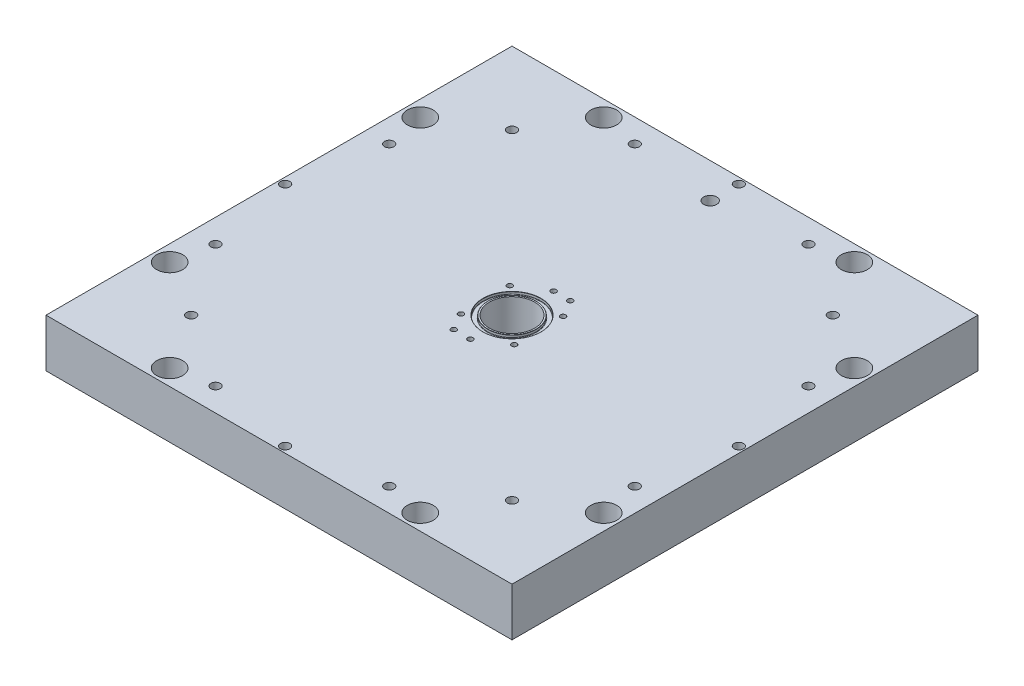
ISO-10303-21;
HEADER;
FILE_DESCRIPTION(('STEP AP214'),'2;1');
FILE_NAME('part.step','',(''),(''),'','','');
FILE_SCHEMA(('AUTOMOTIVE_DESIGN { 1 0 10303 214 1 1 1 1 }'));
ENDSEC;
DATA;
#1=APPLICATION_CONTEXT('core data for automotive mechanical design processes');
#2=APPLICATION_PROTOCOL_DEFINITION('international standard','automotive_design',2000,#1);
#3=PRODUCT_CONTEXT('',#1,'mechanical');
#4=PRODUCT('Part','Part','',(#3));
#5=PRODUCT_RELATED_PRODUCT_CATEGORY('part','',(#4));
#6=PRODUCT_DEFINITION_FORMATION('','',#4);
#7=PRODUCT_DEFINITION_CONTEXT('part definition',#1,'design');
#8=PRODUCT_DEFINITION('design','',#6,#7);
#9=PRODUCT_DEFINITION_SHAPE('','',#8);
#10=(LENGTH_UNIT() NAMED_UNIT(*) SI_UNIT(.MILLI.,.METRE.));
#11=(NAMED_UNIT(*) PLANE_ANGLE_UNIT() SI_UNIT($,.RADIAN.));
#12=(NAMED_UNIT(*) SI_UNIT($,.STERADIAN.) SOLID_ANGLE_UNIT());
#13=UNCERTAINTY_MEASURE_WITH_UNIT(LENGTH_MEASURE(1.E-05),#10,'distance_accuracy_value','');
#14=(GEOMETRIC_REPRESENTATION_CONTEXT(3) GLOBAL_UNCERTAINTY_ASSIGNED_CONTEXT((#13)) GLOBAL_UNIT_ASSIGNED_CONTEXT((#10,
#11,#12)) REPRESENTATION_CONTEXT('',''));
#15=CARTESIAN_POINT('',(0.,0.,0.));
#16=DIRECTION('',(0.,0.,1.));
#17=DIRECTION('',(1.,0.,0.));
#18=AXIS2_PLACEMENT_3D('',#15,#16,#17);
#19=CARTESIAN_POINT('',(0.,38.1,0.));
#20=DIRECTION('',(0.,-1.,0.));
#21=DIRECTION('',(0.,0.,-1.));
#22=AXIS2_PLACEMENT_3D('',#19,#20,#21);
#23=PLANE('',#22);
#24=CARTESIAN_POINT('',(95.6199459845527,38.1,165.61860466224));
#25=DIRECTION('',(0.,1.,0.));
#26=DIRECTION('',(0.,0.,1.));
#27=AXIS2_PLACEMENT_3D('',#24,#25,#26);
#28=CIRCLE('',#27,9.92187499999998);
#29=CARTESIAN_POINT('',(95.6199459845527,38.1,175.54047966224));
#30=VERTEX_POINT('',#29);
#31=EDGE_CURVE('E1410',#30,#30,#28,.T.);
#32=ORIENTED_EDGE('',*,*,#31,.F.);
#33=EDGE_LOOP('',(#32));
#34=FACE_BOUND('',#33,.T.);
#35=CARTESIAN_POINT('',(165.618604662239,38.1,-95.6199459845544));
#36=DIRECTION('',(0.,1.,0.));
#37=DIRECTION('',(0.,0.,1.));
#38=AXIS2_PLACEMENT_3D('',#35,#36,#37);
#39=CIRCLE('',#38,9.921875);
#40=CARTESIAN_POINT('',(165.618604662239,38.1,-85.6980709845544));
#41=VERTEX_POINT('',#40);
#42=EDGE_CURVE('E1422',#41,#41,#39,.T.);
#43=ORIENTED_EDGE('',*,*,#42,.F.);
#44=EDGE_LOOP('',(#43));
#45=FACE_BOUND('',#44,.T.);
#46=CARTESIAN_POINT('',(-95.6199459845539,38.1,-165.61860466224));
#47=DIRECTION('',(0.,1.,0.));
#48=DIRECTION('',(0.,0.,1.));
#49=AXIS2_PLACEMENT_3D('',#46,#47,#48);
#50=CIRCLE('',#49,9.92187499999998);
#51=CARTESIAN_POINT('',(-95.6199459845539,38.1,-155.69672966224));
#52=VERTEX_POINT('',#51);
#53=EDGE_CURVE('E1432',#52,#52,#50,.T.);
#54=ORIENTED_EDGE('',*,*,#53,.F.);
#55=EDGE_LOOP('',(#54));
#56=FACE_BOUND('',#55,.T.);
#57=CARTESIAN_POINT('',(-165.618604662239,38.1,95.6199459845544));
#58=DIRECTION('',(0.,1.,0.));
#59=DIRECTION('',(0.,0.,1.));
#60=AXIS2_PLACEMENT_3D('',#57,#58,#59);
#61=CIRCLE('',#60,9.921875);
#62=CARTESIAN_POINT('',(-165.618604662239,38.1,105.541820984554));
#63=VERTEX_POINT('',#62);
#64=EDGE_CURVE('E1442',#63,#63,#61,.T.);
#65=ORIENTED_EDGE('',*,*,#64,.F.);
#66=EDGE_LOOP('',(#65));
#67=FACE_BOUND('',#66,.T.);
#68=CARTESIAN_POINT('',(-173.1137,38.1,-4.20496970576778E-12));
#69=DIRECTION('',(0.,1.,0.));
#70=DIRECTION('',(0.,0.,1.));
#71=AXIS2_PLACEMENT_3D('',#68,#69,#70);
#72=CIRCLE('',#71,3.57187499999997);
#73=CARTESIAN_POINT('',(-173.1137,38.1,3.57187499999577));
#74=VERTEX_POINT('',#73);
#75=EDGE_CURVE('E1452',#74,#74,#72,.T.);
#76=ORIENTED_EDGE('',*,*,#75,.F.);
#77=EDGE_LOOP('',(#76));
#78=FACE_BOUND('',#77,.T.);
#79=CARTESIAN_POINT('',(-122.409871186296,38.1,122.409871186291));
#80=DIRECTION('',(0.,1.,0.));
#81=DIRECTION('',(0.,0.,1.));
#82=AXIS2_PLACEMENT_3D('',#79,#80,#81);
#83=CIRCLE('',#82,3.57187499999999);
#84=CARTESIAN_POINT('',(-122.409871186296,38.1,125.981746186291));
#85=VERTEX_POINT('',#84);
#86=EDGE_CURVE('E1462',#85,#85,#83,.T.);
#87=ORIENTED_EDGE('',*,*,#86,.F.);
#88=EDGE_LOOP('',(#87));
#89=FACE_BOUND('',#88,.T.);
#90=CARTESIAN_POINT('',(-3.60822483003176E-12,38.1,173.1137));
#91=DIRECTION('',(0.,1.,0.));
#92=DIRECTION('',(0.,0.,1.));
#93=AXIS2_PLACEMENT_3D('',#90,#91,#92);
#94=CIRCLE('',#93,3.57187499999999);
#95=CARTESIAN_POINT('',(-3.60822483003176E-12,38.1,176.685575));
#96=VERTEX_POINT('',#95);
#97=EDGE_CURVE('E1472',#96,#96,#94,.T.);
#98=ORIENTED_EDGE('',*,*,#97,.F.);
#99=EDGE_LOOP('',(#98));
#100=FACE_BOUND('',#99,.T.);
#101=CARTESIAN_POINT('',(122.409871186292,38.1,122.409871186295));
#102=DIRECTION('',(0.,1.,0.));
#103=DIRECTION('',(0.,0.,1.));
#104=AXIS2_PLACEMENT_3D('',#101,#102,#103);
#105=CIRCLE('',#104,3.571875);
#106=CARTESIAN_POINT('',(122.409871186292,38.1,125.981746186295));
#107=VERTEX_POINT('',#106);
#108=EDGE_CURVE('E1482',#107,#107,#105,.T.);
#109=ORIENTED_EDGE('',*,*,#108,.F.);
#110=EDGE_LOOP('',(#109));
#111=FACE_BOUND('',#110,.T.);
#112=CARTESIAN_POINT('',(173.1137,38.1,3.01147995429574E-12));
#113=DIRECTION('',(0.,1.,0.));
#114=DIRECTION('',(0.,0.,1.));
#115=AXIS2_PLACEMENT_3D('',#112,#113,#114);
#116=CIRCLE('',#115,3.57187499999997);
#117=CARTESIAN_POINT('',(173.1137,38.1,3.57187500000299));
#118=VERTEX_POINT('',#117);
#119=EDGE_CURVE('E1492',#118,#118,#116,.T.);
#120=ORIENTED_EDGE('',*,*,#119,.F.);
#121=EDGE_LOOP('',(#120));
#122=FACE_BOUND('',#121,.T.);
#123=CARTESIAN_POINT('',(122.409871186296,38.1,-122.409871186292));
#124=DIRECTION('',(0.,1.,0.));
#125=DIRECTION('',(0.,0.,1.));
#126=AXIS2_PLACEMENT_3D('',#123,#124,#125);
#127=CIRCLE('',#126,3.57187499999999);
#128=CARTESIAN_POINT('',(122.409871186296,38.1,-118.837996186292));
#129=VERTEX_POINT('',#128);
#130=EDGE_CURVE('E1502',#129,#129,#127,.T.);
#131=ORIENTED_EDGE('',*,*,#130,.F.);
#132=EDGE_LOOP('',(#131));
#133=FACE_BOUND('',#132,.T.);
#134=CARTESIAN_POINT('',(2.4008572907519E-12,38.1,-173.1137));
#135=DIRECTION('',(0.,1.,0.));
#136=DIRECTION('',(0.,0.,1.));
#137=AXIS2_PLACEMENT_3D('',#134,#135,#136);
#138=CIRCLE('',#137,3.57187499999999);
#139=CARTESIAN_POINT('',(2.4008572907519E-12,38.1,-169.541825));
#140=VERTEX_POINT('',#139);
#141=EDGE_CURVE('E1512',#140,#140,#138,.T.);
#142=ORIENTED_EDGE('',*,*,#141,.F.);
#143=EDGE_LOOP('',(#142));
#144=FACE_BOUND('',#143,.T.);
#145=CARTESIAN_POINT('',(-122.409871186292,38.1,-122.409871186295));
#146=DIRECTION('',(0.,1.,0.));
#147=DIRECTION('',(0.,0.,1.));
#148=AXIS2_PLACEMENT_3D('',#145,#146,#147);
#149=CIRCLE('',#148,3.57187499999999);
#150=CARTESIAN_POINT('',(-122.409871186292,38.1,-118.837996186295));
#151=VERTEX_POINT('',#150);
#152=EDGE_CURVE('E1522',#151,#151,#149,.T.);
#153=ORIENTED_EDGE('',*,*,#152,.F.);
#154=EDGE_LOOP('',(#153));
#155=FACE_BOUND('',#154,.T.);
#156=CARTESIAN_POINT('',(0.,38.1,-151.27));
#157=DIRECTION('',(0.,1.,0.));
#158=DIRECTION('',(0.,0.,1.));
#159=AXIS2_PLACEMENT_3D('',#156,#157,#158);
#160=CIRCLE('',#159,4.96061999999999);
#161=CARTESIAN_POINT('',(0.,38.1,-146.30938));
#162=VERTEX_POINT('',#161);
#163=EDGE_CURVE('E173',#162,#162,#160,.T.);
#164=ORIENTED_EDGE('',*,*,#163,.F.);
#165=EDGE_LOOP('',(#164));
#166=FACE_BOUND('',#165,.T.);
#167=CARTESIAN_POINT('',(0.,38.1,0.));
#168=DIRECTION('',(0.,-1.,0.));
#169=DIRECTION('',(0.,0.,-1.));
#170=AXIS2_PLACEMENT_3D('',#167,#168,#169);
#171=CIRCLE('',#170,22.1869);
#172=CARTESIAN_POINT('',(0.,38.1,-22.1869));
#173=VERTEX_POINT('',#172);
#174=EDGE_CURVE('E167',#173,#173,#171,.T.);
#175=ORIENTED_EDGE('',*,*,#174,.T.);
#176=EDGE_LOOP('',(#175));
#177=FACE_BOUND('',#176,.T.);
#178=CARTESIAN_POINT('',(-20.3441951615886,38.1,-18.6426308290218));
#179=DIRECTION('',(0.,1.,0.));
#180=DIRECTION('',(0.,0.,1.));
#181=AXIS2_PLACEMENT_3D('',#178,#179,#180);
#182=CIRCLE('',#181,2.0193);
#183=CARTESIAN_POINT('',(-20.3441951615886,38.1,-16.6233308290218));
#184=VERTEX_POINT('',#183);
#185=EDGE_CURVE('E285',#184,#184,#182,.T.);
#186=ORIENTED_EDGE('',*,*,#185,.F.);
#187=EDGE_LOOP('',(#186));
#188=FACE_BOUND('',#187,.T.);
#189=CARTESIAN_POINT('',(20.2957706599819,38.1,-18.6953377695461));
#190=DIRECTION('',(0.,1.,0.));
#191=DIRECTION('',(0.,0.,1.));
#192=AXIS2_PLACEMENT_3D('',#189,#190,#191);
#193=CIRCLE('',#192,2.0193);
#194=CARTESIAN_POINT('',(20.2957706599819,38.1,-16.6760377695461));
#195=VERTEX_POINT('',#194);
#196=EDGE_CURVE('E291',#195,#195,#193,.T.);
#197=ORIENTED_EDGE('',*,*,#196,.F.);
#198=EDGE_LOOP('',(#197));
#199=FACE_BOUND('',#198,.T.);
#200=CARTESIAN_POINT('',(20.3441951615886,38.1,18.6426308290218));
#201=DIRECTION('',(0.,1.,0.));
#202=DIRECTION('',(0.,0.,1.));
#203=AXIS2_PLACEMENT_3D('',#200,#201,#202);
#204=CIRCLE('',#203,2.0193);
#205=CARTESIAN_POINT('',(20.3441951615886,38.1,20.6619308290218));
#206=VERTEX_POINT('',#205);
#207=EDGE_CURVE('E297',#206,#206,#204,.T.);
#208=ORIENTED_EDGE('',*,*,#207,.F.);
#209=EDGE_LOOP('',(#208));
#210=FACE_BOUND('',#209,.T.);
#211=CARTESIAN_POINT('',(0.,38.1,31.75));
#212=DIRECTION('',(0.,1.,0.));
#213=DIRECTION('',(0.,0.,1.));
#214=AXIS2_PLACEMENT_3D('',#211,#212,#213);
#215=CIRCLE('',#214,2.0193);
#216=CARTESIAN_POINT('',(0.,38.1,33.7693));
#217=VERTEX_POINT('',#216);
#218=EDGE_CURVE('E303',#217,#217,#215,.T.);
#219=ORIENTED_EDGE('',*,*,#218,.F.);
#220=EDGE_LOOP('',(#219));
#221=FACE_BOUND('',#220,.T.);
#222=CARTESIAN_POINT('',(-12.7,38.1,31.75));
#223=DIRECTION('',(0.,1.,0.));
#224=DIRECTION('',(0.,0.,1.));
#225=AXIS2_PLACEMENT_3D('',#222,#223,#224);
#226=CIRCLE('',#225,2.0193);
#227=CARTESIAN_POINT('',(-12.7,38.1,33.7693));
#228=VERTEX_POINT('',#227);
#229=EDGE_CURVE('E309',#228,#228,#226,.T.);
#230=ORIENTED_EDGE('',*,*,#229,.F.);
#231=EDGE_LOOP('',(#230));
#232=FACE_BOUND('',#231,.T.);
#233=CARTESIAN_POINT('',(-20.2957706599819,38.1,18.6953377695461));
#234=DIRECTION('',(0.,1.,0.));
#235=DIRECTION('',(0.,0.,1.));
#236=AXIS2_PLACEMENT_3D('',#233,#234,#235);
#237=CIRCLE('',#236,2.0193);
#238=CARTESIAN_POINT('',(-20.2957706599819,38.1,20.7146377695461));
#239=VERTEX_POINT('',#238);
#240=EDGE_CURVE('E315',#239,#239,#237,.T.);
#241=ORIENTED_EDGE('',*,*,#240,.F.);
#242=EDGE_LOOP('',(#241));
#243=FACE_BOUND('',#242,.T.);
#244=CARTESIAN_POINT('',(2.28983498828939E-13,38.1,-31.75));
#245=DIRECTION('',(0.,1.,0.));
#246=DIRECTION('',(0.,0.,1.));
#247=AXIS2_PLACEMENT_3D('',#244,#245,#246);
#248=CIRCLE('',#247,2.0193);
#249=CARTESIAN_POINT('',(2.28983498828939E-13,38.1,-29.7307));
#250=VERTEX_POINT('',#249);
#251=EDGE_CURVE('E321',#250,#250,#248,.T.);
#252=ORIENTED_EDGE('',*,*,#251,.F.);
#253=EDGE_LOOP('',(#252));
#254=FACE_BOUND('',#253,.T.);
#255=CARTESIAN_POINT('',(12.7000000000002,38.1,-31.7499999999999));
#256=DIRECTION('',(0.,1.,0.));
#257=DIRECTION('',(0.,0.,1.));
#258=AXIS2_PLACEMENT_3D('',#255,#256,#257);
#259=CIRCLE('',#258,2.0193);
#260=CARTESIAN_POINT('',(12.7000000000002,38.1,-29.7306999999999));
#261=VERTEX_POINT('',#260);
#262=EDGE_CURVE('E327',#261,#261,#259,.T.);
#263=ORIENTED_EDGE('',*,*,#262,.F.);
#264=EDGE_LOOP('',(#263));
#265=FACE_BOUND('',#264,.T.);
#266=DIRECTION('',(0.,0.,-1.));
#267=VECTOR('',#266,1.);
#268=CARTESIAN_POINT('',(177.8,38.1,177.8));
#269=LINE('',#268,#267);
#270=CARTESIAN_POINT('',(177.8,38.1,177.8));
#271=VERTEX_POINT('',#270);
#272=CARTESIAN_POINT('',(177.8,38.1,-177.8));
#273=VERTEX_POINT('',#272);
#274=EDGE_CURVE('E336',#271,#273,#269,.T.);
#275=ORIENTED_EDGE('',*,*,#274,.T.);
#276=DIRECTION('',(-1.,0.,0.));
#277=VECTOR('',#276,1.);
#278=CARTESIAN_POINT('',(-177.8,38.1,-177.8));
#279=LINE('',#278,#277);
#280=CARTESIAN_POINT('',(-177.8,38.1,-177.8));
#281=VERTEX_POINT('',#280);
#282=EDGE_CURVE('E339',#273,#281,#279,.T.);
#283=ORIENTED_EDGE('',*,*,#282,.T.);
#284=DIRECTION('',(0.,0.,1.));
#285=VECTOR('',#284,1.);
#286=CARTESIAN_POINT('',(-177.8,38.1,177.8));
#287=LINE('',#286,#285);
#288=CARTESIAN_POINT('',(-177.8,38.1,177.8));
#289=VERTEX_POINT('',#288);
#290=EDGE_CURVE('E341',#281,#289,#287,.T.);
#291=ORIENTED_EDGE('',*,*,#290,.T.);
#292=DIRECTION('',(1.,0.,0.));
#293=VECTOR('',#292,1.);
#294=CARTESIAN_POINT('',(-177.8,38.1,177.8));
#295=LINE('',#294,#293);
#296=EDGE_CURVE('E343',#289,#271,#295,.T.);
#297=ORIENTED_EDGE('',*,*,#296,.T.);
#298=EDGE_LOOP('',(#275,#283,#291,#297));
#299=FACE_BOUND('',#298,.T.);
#300=CARTESIAN_POINT('',(-66.2477449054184,38.1,-159.9362042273));
#301=DIRECTION('',(0.,1.,0.));
#302=DIRECTION('',(0.,0.,1.));
#303=AXIS2_PLACEMENT_3D('',#300,#301,#302);
#304=CIRCLE('',#303,3.57187499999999);
#305=CARTESIAN_POINT('',(-66.2477449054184,38.1,-156.3643292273));
#306=VERTEX_POINT('',#305);
#307=EDGE_CURVE('E1364',#306,#306,#304,.T.);
#308=ORIENTED_EDGE('',*,*,#307,.F.);
#309=EDGE_LOOP('',(#308));
#310=FACE_BOUND('',#309,.T.);
#311=CARTESIAN_POINT('',(66.2477449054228,38.1,-159.936204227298));
#312=DIRECTION('',(0.,1.,0.));
#313=DIRECTION('',(0.,0.,1.));
#314=AXIS2_PLACEMENT_3D('',#311,#312,#313);
#315=CIRCLE('',#314,3.57187499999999);
#316=CARTESIAN_POINT('',(66.2477449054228,38.1,-156.364329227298));
#317=VERTEX_POINT('',#316);
#318=EDGE_CURVE('E1368',#317,#317,#315,.T.);
#319=ORIENTED_EDGE('',*,*,#318,.F.);
#320=EDGE_LOOP('',(#319));
#321=FACE_BOUND('',#320,.T.);
#322=CARTESIAN_POINT('',(159.9362042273,38.1,-66.2477449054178));
#323=DIRECTION('',(0.,1.,0.));
#324=DIRECTION('',(0.,0.,1.));
#325=AXIS2_PLACEMENT_3D('',#322,#323,#324);
#326=CIRCLE('',#325,3.571875);
#327=CARTESIAN_POINT('',(159.9362042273,38.1,-62.6758699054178));
#328=VERTEX_POINT('',#327);
#329=EDGE_CURVE('E1372',#328,#328,#326,.T.);
#330=ORIENTED_EDGE('',*,*,#329,.F.);
#331=EDGE_LOOP('',(#330));
#332=FACE_BOUND('',#331,.T.);
#333=CARTESIAN_POINT('',(159.936204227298,38.1,66.2477449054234));
#334=DIRECTION('',(0.,1.,0.));
#335=DIRECTION('',(0.,0.,1.));
#336=AXIS2_PLACEMENT_3D('',#333,#334,#335);
#337=CIRCLE('',#336,3.571875);
#338=CARTESIAN_POINT('',(159.936204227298,38.1,69.8196199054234));
#339=VERTEX_POINT('',#338);
#340=EDGE_CURVE('E1376',#339,#339,#337,.T.);
#341=ORIENTED_EDGE('',*,*,#340,.F.);
#342=EDGE_LOOP('',(#341));
#343=FACE_BOUND('',#342,.T.);
#344=CARTESIAN_POINT('',(66.2477449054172,38.1,159.9362042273));
#345=DIRECTION('',(0.,1.,0.));
#346=DIRECTION('',(0.,0.,1.));
#347=AXIS2_PLACEMENT_3D('',#344,#345,#346);
#348=CIRCLE('',#347,3.57187499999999);
#349=CARTESIAN_POINT('',(66.2477449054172,38.1,163.5080792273));
#350=VERTEX_POINT('',#349);
#351=EDGE_CURVE('E1380',#350,#350,#348,.T.);
#352=ORIENTED_EDGE('',*,*,#351,.F.);
#353=EDGE_LOOP('',(#352));
#354=FACE_BOUND('',#353,.T.);
#355=CARTESIAN_POINT('',(-66.247744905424,38.1,159.936204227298));
#356=DIRECTION('',(0.,1.,0.));
#357=DIRECTION('',(0.,0.,1.));
#358=AXIS2_PLACEMENT_3D('',#355,#356,#357);
#359=CIRCLE('',#358,3.57187499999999);
#360=CARTESIAN_POINT('',(-66.247744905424,38.1,163.508079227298));
#361=VERTEX_POINT('',#360);
#362=EDGE_CURVE('E1384',#361,#361,#359,.T.);
#363=ORIENTED_EDGE('',*,*,#362,.F.);
#364=EDGE_LOOP('',(#363));
#365=FACE_BOUND('',#364,.T.);
#366=CARTESIAN_POINT('',(-159.936204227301,38.1,66.2477449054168));
#367=DIRECTION('',(0.,1.,0.));
#368=DIRECTION('',(0.,0.,1.));
#369=AXIS2_PLACEMENT_3D('',#366,#367,#368);
#370=CIRCLE('',#369,3.57187499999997);
#371=CARTESIAN_POINT('',(-159.936204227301,38.1,69.8196199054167));
#372=VERTEX_POINT('',#371);
#373=EDGE_CURVE('E1388',#372,#372,#370,.T.);
#374=ORIENTED_EDGE('',*,*,#373,.F.);
#375=EDGE_LOOP('',(#374));
#376=FACE_BOUND('',#375,.T.);
#377=CARTESIAN_POINT('',(-159.936204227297,38.1,-66.2477449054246));
#378=DIRECTION('',(0.,1.,0.));
#379=DIRECTION('',(0.,0.,1.));
#380=AXIS2_PLACEMENT_3D('',#377,#378,#379);
#381=CIRCLE('',#380,3.571875);
#382=CARTESIAN_POINT('',(-159.936204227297,38.1,-62.6758699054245));
#383=VERTEX_POINT('',#382);
#384=EDGE_CURVE('E1392',#383,#383,#381,.T.);
#385=ORIENTED_EDGE('',*,*,#384,.F.);
#386=EDGE_LOOP('',(#385));
#387=FACE_BOUND('',#386,.T.);
#388=CARTESIAN_POINT('',(-95.6199459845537,38.1,165.61860466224));
#389=DIRECTION('',(0.,1.,0.));
#390=DIRECTION('',(0.,0.,1.));
#391=AXIS2_PLACEMENT_3D('',#388,#389,#390);
#392=CIRCLE('',#391,9.92187499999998);
#393=CARTESIAN_POINT('',(-95.6199459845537,38.1,175.54047966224));
#394=VERTEX_POINT('',#393);
#395=EDGE_CURVE('E1396',#394,#394,#392,.T.);
#396=ORIENTED_EDGE('',*,*,#395,.F.);
#397=EDGE_LOOP('',(#396));
#398=FACE_BOUND('',#397,.T.);
#399=CARTESIAN_POINT('',(-165.618604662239,38.1,-95.6199459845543));
#400=DIRECTION('',(0.,1.,0.));
#401=DIRECTION('',(0.,0.,1.));
#402=AXIS2_PLACEMENT_3D('',#399,#400,#401);
#403=CIRCLE('',#402,9.921875);
#404=CARTESIAN_POINT('',(-165.618604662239,38.1,-85.6980709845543));
#405=VERTEX_POINT('',#404);
#406=EDGE_CURVE('E1400',#405,#405,#403,.T.);
#407=ORIENTED_EDGE('',*,*,#406,.F.);
#408=EDGE_LOOP('',(#407));
#409=FACE_BOUND('',#408,.T.);
#410=CARTESIAN_POINT('',(95.6199459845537,38.1,-165.61860466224));
#411=DIRECTION('',(0.,1.,0.));
#412=DIRECTION('',(0.,0.,1.));
#413=AXIS2_PLACEMENT_3D('',#410,#411,#412);
#414=CIRCLE('',#413,9.92187499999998);
#415=CARTESIAN_POINT('',(95.6199459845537,38.1,-155.69672966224));
#416=VERTEX_POINT('',#415);
#417=EDGE_CURVE('E1404',#416,#416,#414,.T.);
#418=ORIENTED_EDGE('',*,*,#417,.F.);
#419=EDGE_LOOP('',(#418));
#420=FACE_BOUND('',#419,.T.);
#421=CARTESIAN_POINT('',(165.618604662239,38.1,95.6199459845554));
#422=DIRECTION('',(0.,1.,0.));
#423=DIRECTION('',(0.,0.,1.));
#424=AXIS2_PLACEMENT_3D('',#421,#422,#423);
#425=CIRCLE('',#424,9.921875);
#426=CARTESIAN_POINT('',(165.618604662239,38.1,105.541820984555));
#427=VERTEX_POINT('',#426);
#428=EDGE_CURVE('E1406',#427,#427,#425,.T.);
#429=ORIENTED_EDGE('',*,*,#428,.F.);
#430=EDGE_LOOP('',(#429));
#431=FACE_BOUND('',#430,.T.);
#432=ADVANCED_FACE('F37',(#34,#45,#56,#67,#78,#89,#100,#111,#122,#133,#144,#155,#166,#177,#188,
#199,#210,#221,#232,#243,#254,#265,#299,#310,#321,#332,#343,#354,#365,#376,#387,#398,#409,#420,
#431),#23,.F.);
#433=CARTESIAN_POINT('',(0.,1.27,0.));
#434=DIRECTION('',(0.,-1.,0.));
#435=DIRECTION('',(0.,0.,-1.));
#436=AXIS2_PLACEMENT_3D('',#433,#434,#435);
#437=PLANE('',#436);
#438=CARTESIAN_POINT('',(165.618604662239,1.27,95.6199459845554));
#439=DIRECTION('',(0.,-1.,0.));
#440=DIRECTION('',(0.,0.,-1.));
#441=AXIS2_PLACEMENT_3D('',#438,#439,#440);
#442=CIRCLE('',#441,9.921875);
#443=CARTESIAN_POINT('',(165.618604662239,1.27,85.6980709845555));
#444=VERTEX_POINT('',#443);
#445=EDGE_CURVE('E1407',#444,#444,#442,.T.);
#446=ORIENTED_EDGE('',*,*,#445,.F.);
#447=EDGE_LOOP('',(#446));
#448=FACE_BOUND('',#447,.T.);
#449=CARTESIAN_POINT('',(95.6199459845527,1.27,165.61860466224));
#450=DIRECTION('',(0.,-1.,0.));
#451=DIRECTION('',(0.,0.,-1.));
#452=AXIS2_PLACEMENT_3D('',#449,#450,#451);
#453=CIRCLE('',#452,9.92187499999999);
#454=CARTESIAN_POINT('',(95.6199459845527,1.27,155.69672966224));
#455=VERTEX_POINT('',#454);
#456=EDGE_CURVE('E1415',#455,#455,#453,.T.);
#457=ORIENTED_EDGE('',*,*,#456,.F.);
#458=EDGE_LOOP('',(#457));
#459=FACE_BOUND('',#458,.T.);
#460=CARTESIAN_POINT('',(95.6199459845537,1.27,-165.61860466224));
#461=DIRECTION('',(0.,-1.,0.));
#462=DIRECTION('',(0.,0.,-1.));
#463=AXIS2_PLACEMENT_3D('',#460,#461,#462);
#464=CIRCLE('',#463,9.92187499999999);
#465=CARTESIAN_POINT('',(95.6199459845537,1.27,-175.54047966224));
#466=VERTEX_POINT('',#465);
#467=EDGE_CURVE('E1419',#466,#466,#464,.T.);
#468=ORIENTED_EDGE('',*,*,#467,.F.);
#469=EDGE_LOOP('',(#468));
#470=FACE_BOUND('',#469,.T.);
#471=CARTESIAN_POINT('',(165.618604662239,1.27,-95.6199459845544));
#472=DIRECTION('',(0.,-1.,0.));
#473=DIRECTION('',(0.,0.,-1.));
#474=AXIS2_PLACEMENT_3D('',#471,#472,#473);
#475=CIRCLE('',#474,9.921875);
#476=CARTESIAN_POINT('',(165.618604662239,1.27,-105.541820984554));
#477=VERTEX_POINT('',#476);
#478=EDGE_CURVE('E1425',#477,#477,#475,.T.);
#479=ORIENTED_EDGE('',*,*,#478,.F.);
#480=EDGE_LOOP('',(#479));
#481=FACE_BOUND('',#480,.T.);
#482=CARTESIAN_POINT('',(-165.618604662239,1.27,-95.6199459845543));
#483=DIRECTION('',(0.,-1.,0.));
#484=DIRECTION('',(0.,0.,-1.));
#485=AXIS2_PLACEMENT_3D('',#482,#483,#484);
#486=CIRCLE('',#485,9.921875);
#487=CARTESIAN_POINT('',(-165.618604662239,1.27,-105.541820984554));
#488=VERTEX_POINT('',#487);
#489=EDGE_CURVE('E1429',#488,#488,#486,.T.);
#490=ORIENTED_EDGE('',*,*,#489,.F.);
#491=EDGE_LOOP('',(#490));
#492=FACE_BOUND('',#491,.T.);
#493=CARTESIAN_POINT('',(-95.6199459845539,1.27,-165.61860466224));
#494=DIRECTION('',(0.,-1.,0.));
#495=DIRECTION('',(0.,0.,-1.));
#496=AXIS2_PLACEMENT_3D('',#493,#494,#495);
#497=CIRCLE('',#496,9.92187499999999);
#498=CARTESIAN_POINT('',(-95.6199459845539,1.27,-175.54047966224));
#499=VERTEX_POINT('',#498);
#500=EDGE_CURVE('E1435',#499,#499,#497,.T.);
#501=ORIENTED_EDGE('',*,*,#500,.F.);
#502=EDGE_LOOP('',(#501));
#503=FACE_BOUND('',#502,.T.);
#504=CARTESIAN_POINT('',(-95.6199459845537,1.27,165.61860466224));
#505=DIRECTION('',(0.,-1.,0.));
#506=DIRECTION('',(0.,0.,-1.));
#507=AXIS2_PLACEMENT_3D('',#504,#505,#506);
#508=CIRCLE('',#507,9.92187499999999);
#509=CARTESIAN_POINT('',(-95.6199459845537,1.27,155.69672966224));
#510=VERTEX_POINT('',#509);
#511=EDGE_CURVE('E1439',#510,#510,#508,.T.);
#512=ORIENTED_EDGE('',*,*,#511,.F.);
#513=EDGE_LOOP('',(#512));
#514=FACE_BOUND('',#513,.T.);
#515=CARTESIAN_POINT('',(-165.618604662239,1.27,95.6199459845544));
#516=DIRECTION('',(0.,-1.,0.));
#517=DIRECTION('',(0.,0.,-1.));
#518=AXIS2_PLACEMENT_3D('',#515,#516,#517);
#519=CIRCLE('',#518,9.921875);
#520=CARTESIAN_POINT('',(-165.618604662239,1.27,85.6980709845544));
#521=VERTEX_POINT('',#520);
#522=EDGE_CURVE('E1445',#521,#521,#519,.T.);
#523=ORIENTED_EDGE('',*,*,#522,.F.);
#524=EDGE_LOOP('',(#523));
#525=FACE_BOUND('',#524,.T.);
#526=CARTESIAN_POINT('',(-159.936204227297,1.27,-66.2477449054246));
#527=DIRECTION('',(0.,-1.,0.));
#528=DIRECTION('',(0.,0.,-1.));
#529=AXIS2_PLACEMENT_3D('',#526,#527,#528);
#530=CIRCLE('',#529,3.571875);
#531=CARTESIAN_POINT('',(-159.936204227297,1.27,-69.8196199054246));
#532=VERTEX_POINT('',#531);
#533=EDGE_CURVE('E1449',#532,#532,#530,.T.);
#534=ORIENTED_EDGE('',*,*,#533,.F.);
#535=EDGE_LOOP('',(#534));
#536=FACE_BOUND('',#535,.T.);
#537=CARTESIAN_POINT('',(-173.1137,1.27,-4.20496970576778E-12));
#538=DIRECTION('',(0.,-1.,0.));
#539=DIRECTION('',(0.,0.,-1.));
#540=AXIS2_PLACEMENT_3D('',#537,#538,#539);
#541=CIRCLE('',#540,3.57187499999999);
#542=CARTESIAN_POINT('',(-173.1137,1.27,-3.57187500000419));
#543=VERTEX_POINT('',#542);
#544=EDGE_CURVE('E1455',#543,#543,#541,.T.);
#545=ORIENTED_EDGE('',*,*,#544,.F.);
#546=EDGE_LOOP('',(#545));
#547=FACE_BOUND('',#546,.T.);
#548=CARTESIAN_POINT('',(-159.936204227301,1.27,66.2477449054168));
#549=DIRECTION('',(0.,-1.,0.));
#550=DIRECTION('',(0.,0.,-1.));
#551=AXIS2_PLACEMENT_3D('',#548,#549,#550);
#552=CIRCLE('',#551,3.57187499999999);
#553=CARTESIAN_POINT('',(-159.936204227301,1.27,62.6758699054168));
#554=VERTEX_POINT('',#553);
#555=EDGE_CURVE('E1459',#554,#554,#552,.T.);
#556=ORIENTED_EDGE('',*,*,#555,.F.);
#557=EDGE_LOOP('',(#556));
#558=FACE_BOUND('',#557,.T.);
#559=CARTESIAN_POINT('',(-122.409871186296,1.27,122.409871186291));
#560=DIRECTION('',(0.,-1.,0.));
#561=DIRECTION('',(0.,0.,-1.));
#562=AXIS2_PLACEMENT_3D('',#559,#560,#561);
#563=CIRCLE('',#562,3.57187499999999);
#564=CARTESIAN_POINT('',(-122.409871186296,1.27,118.837996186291));
#565=VERTEX_POINT('',#564);
#566=EDGE_CURVE('E1465',#565,#565,#563,.T.);
#567=ORIENTED_EDGE('',*,*,#566,.F.);
#568=EDGE_LOOP('',(#567));
#569=FACE_BOUND('',#568,.T.);
#570=CARTESIAN_POINT('',(-66.247744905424,1.27,159.936204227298));
#571=DIRECTION('',(0.,-1.,0.));
#572=DIRECTION('',(0.,0.,-1.));
#573=AXIS2_PLACEMENT_3D('',#570,#571,#572);
#574=CIRCLE('',#573,3.57187499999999);
#575=CARTESIAN_POINT('',(-66.247744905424,1.27,156.364329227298));
#576=VERTEX_POINT('',#575);
#577=EDGE_CURVE('E1469',#576,#576,#574,.T.);
#578=ORIENTED_EDGE('',*,*,#577,.F.);
#579=EDGE_LOOP('',(#578));
#580=FACE_BOUND('',#579,.T.);
#581=CARTESIAN_POINT('',(-3.60822483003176E-12,1.27,173.1137));
#582=DIRECTION('',(0.,-1.,0.));
#583=DIRECTION('',(0.,0.,-1.));
#584=AXIS2_PLACEMENT_3D('',#581,#582,#583);
#585=CIRCLE('',#584,3.57187499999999);
#586=CARTESIAN_POINT('',(-3.60822483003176E-12,1.27,169.541825));
#587=VERTEX_POINT('',#586);
#588=EDGE_CURVE('E1475',#587,#587,#585,.T.);
#589=ORIENTED_EDGE('',*,*,#588,.F.);
#590=EDGE_LOOP('',(#589));
#591=FACE_BOUND('',#590,.T.);
#592=CARTESIAN_POINT('',(66.2477449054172,1.27,159.9362042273));
#593=DIRECTION('',(0.,-1.,0.));
#594=DIRECTION('',(0.,0.,-1.));
#595=AXIS2_PLACEMENT_3D('',#592,#593,#594);
#596=CIRCLE('',#595,3.57187499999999);
#597=CARTESIAN_POINT('',(66.2477449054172,1.27,156.3643292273));
#598=VERTEX_POINT('',#597);
#599=EDGE_CURVE('E1479',#598,#598,#596,.T.);
#600=ORIENTED_EDGE('',*,*,#599,.F.);
#601=EDGE_LOOP('',(#600));
#602=FACE_BOUND('',#601,.T.);
#603=CARTESIAN_POINT('',(122.409871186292,1.27,122.409871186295));
#604=DIRECTION('',(0.,-1.,0.));
#605=DIRECTION('',(0.,0.,-1.));
#606=AXIS2_PLACEMENT_3D('',#603,#604,#605);
#607=CIRCLE('',#606,3.571875);
#608=CARTESIAN_POINT('',(122.409871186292,1.27,118.837996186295));
#609=VERTEX_POINT('',#608);
#610=EDGE_CURVE('E1485',#609,#609,#607,.T.);
#611=ORIENTED_EDGE('',*,*,#610,.F.);
#612=EDGE_LOOP('',(#611));
#613=FACE_BOUND('',#612,.T.);
#614=CARTESIAN_POINT('',(159.936204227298,1.27,66.2477449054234));
#615=DIRECTION('',(0.,-1.,0.));
#616=DIRECTION('',(0.,0.,-1.));
#617=AXIS2_PLACEMENT_3D('',#614,#615,#616);
#618=CIRCLE('',#617,3.571875);
#619=CARTESIAN_POINT('',(159.936204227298,1.27,62.6758699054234));
#620=VERTEX_POINT('',#619);
#621=EDGE_CURVE('E1489',#620,#620,#618,.T.);
#622=ORIENTED_EDGE('',*,*,#621,.F.);
#623=EDGE_LOOP('',(#622));
#624=FACE_BOUND('',#623,.T.);
#625=CARTESIAN_POINT('',(173.1137,1.27,3.01147995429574E-12));
#626=DIRECTION('',(0.,-1.,0.));
#627=DIRECTION('',(0.,0.,-1.));
#628=AXIS2_PLACEMENT_3D('',#625,#626,#627);
#629=CIRCLE('',#628,3.57187499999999);
#630=CARTESIAN_POINT('',(173.1137,1.27,-3.57187499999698));
#631=VERTEX_POINT('',#630);
#632=EDGE_CURVE('E1495',#631,#631,#629,.T.);
#633=ORIENTED_EDGE('',*,*,#632,.F.);
#634=EDGE_LOOP('',(#633));
#635=FACE_BOUND('',#634,.T.);
#636=CARTESIAN_POINT('',(159.9362042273,1.27,-66.2477449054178));
#637=DIRECTION('',(0.,-1.,0.));
#638=DIRECTION('',(0.,0.,-1.));
#639=AXIS2_PLACEMENT_3D('',#636,#637,#638);
#640=CIRCLE('',#639,3.571875);
#641=CARTESIAN_POINT('',(159.9362042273,1.27,-69.8196199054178));
#642=VERTEX_POINT('',#641);
#643=EDGE_CURVE('E1499',#642,#642,#640,.T.);
#644=ORIENTED_EDGE('',*,*,#643,.F.);
#645=EDGE_LOOP('',(#644));
#646=FACE_BOUND('',#645,.T.);
#647=CARTESIAN_POINT('',(122.409871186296,1.27,-122.409871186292));
#648=DIRECTION('',(0.,-1.,0.));
#649=DIRECTION('',(0.,0.,-1.));
#650=AXIS2_PLACEMENT_3D('',#647,#648,#649);
#651=CIRCLE('',#650,3.57187499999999);
#652=CARTESIAN_POINT('',(122.409871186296,1.27,-125.981746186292));
#653=VERTEX_POINT('',#652);
#654=EDGE_CURVE('E1505',#653,#653,#651,.T.);
#655=ORIENTED_EDGE('',*,*,#654,.F.);
#656=EDGE_LOOP('',(#655));
#657=FACE_BOUND('',#656,.T.);
#658=CARTESIAN_POINT('',(66.2477449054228,1.27,-159.936204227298));
#659=DIRECTION('',(0.,-1.,0.));
#660=DIRECTION('',(0.,0.,-1.));
#661=AXIS2_PLACEMENT_3D('',#658,#659,#660);
#662=CIRCLE('',#661,3.57187499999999);
#663=CARTESIAN_POINT('',(66.2477449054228,1.27,-163.508079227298));
#664=VERTEX_POINT('',#663);
#665=EDGE_CURVE('E1509',#664,#664,#662,.T.);
#666=ORIENTED_EDGE('',*,*,#665,.F.);
#667=EDGE_LOOP('',(#666));
#668=FACE_BOUND('',#667,.T.);
#669=CARTESIAN_POINT('',(2.4008572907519E-12,1.27,-173.1137));
#670=DIRECTION('',(0.,-1.,0.));
#671=DIRECTION('',(0.,0.,-1.));
#672=AXIS2_PLACEMENT_3D('',#669,#670,#671);
#673=CIRCLE('',#672,3.57187499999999);
#674=CARTESIAN_POINT('',(2.4008572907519E-12,1.27,-176.685575));
#675=VERTEX_POINT('',#674);
#676=EDGE_CURVE('E1515',#675,#675,#673,.T.);
#677=ORIENTED_EDGE('',*,*,#676,.F.);
#678=EDGE_LOOP('',(#677));
#679=FACE_BOUND('',#678,.T.);
#680=CARTESIAN_POINT('',(-66.2477449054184,1.27,-159.9362042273));
#681=DIRECTION('',(0.,-1.,0.));
#682=DIRECTION('',(0.,0.,-1.));
#683=AXIS2_PLACEMENT_3D('',#680,#681,#682);
#684=CIRCLE('',#683,3.57187499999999);
#685=CARTESIAN_POINT('',(-66.2477449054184,1.27,-163.5080792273));
#686=VERTEX_POINT('',#685);
#687=EDGE_CURVE('E1519',#686,#686,#684,.T.);
#688=ORIENTED_EDGE('',*,*,#687,.F.);
#689=EDGE_LOOP('',(#688));
#690=FACE_BOUND('',#689,.T.);
#691=CARTESIAN_POINT('',(-122.409871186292,1.27,-122.409871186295));
#692=DIRECTION('',(0.,-1.,0.));
#693=DIRECTION('',(0.,0.,-1.));
#694=AXIS2_PLACEMENT_3D('',#691,#692,#693);
#695=CIRCLE('',#694,3.57187499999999);
#696=CARTESIAN_POINT('',(-122.409871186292,1.27,-125.981746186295));
#697=VERTEX_POINT('',#696);
#698=EDGE_CURVE('E1525',#697,#697,#695,.T.);
#699=ORIENTED_EDGE('',*,*,#698,.F.);
#700=EDGE_LOOP('',(#699));
#701=FACE_BOUND('',#700,.T.);
#702=DIRECTION('',(0.,0.,1.));
#703=VECTOR('',#702,1.);
#704=CARTESIAN_POINT('',(177.8,1.27,177.8));
#705=LINE('',#704,#703);
#706=CARTESIAN_POINT('',(177.8,1.27,-177.8));
#707=VERTEX_POINT('',#706);
#708=CARTESIAN_POINT('',(177.8,1.27000000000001,177.8));
#709=VERTEX_POINT('',#708);
#710=EDGE_CURVE('E59',#707,#709,#705,.T.);
#711=ORIENTED_EDGE('',*,*,#710,.T.);
#712=DIRECTION('',(-1.,0.,0.));
#713=VECTOR('',#712,1.);
#714=CARTESIAN_POINT('',(-177.8,1.27,177.8));
#715=LINE('',#714,#713);
#716=CARTESIAN_POINT('',(-177.8,1.27,177.8));
#717=VERTEX_POINT('',#716);
#718=EDGE_CURVE('E357',#709,#717,#715,.T.);
#719=ORIENTED_EDGE('',*,*,#718,.T.);
#720=DIRECTION('',(0.,0.,-1.));
#721=VECTOR('',#720,1.);
#722=CARTESIAN_POINT('',(-177.8,1.27,177.8));
#723=LINE('',#722,#721);
#724=CARTESIAN_POINT('',(-177.8,1.27,-177.8));
#725=VERTEX_POINT('',#724);
#726=EDGE_CURVE('E176',#717,#725,#723,.T.);
#727=ORIENTED_EDGE('',*,*,#726,.T.);
#728=DIRECTION('',(1.,0.,0.));
#729=VECTOR('',#728,1.);
#730=CARTESIAN_POINT('',(-177.8,1.27,-177.8));
#731=LINE('',#730,#729);
#732=EDGE_CURVE('E179',#725,#707,#731,.T.);
#733=ORIENTED_EDGE('',*,*,#732,.T.);
#734=EDGE_LOOP('',(#711,#719,#727,#733));
#735=FACE_BOUND('',#734,.T.);
#736=CARTESIAN_POINT('',(0.,1.27,0.));
#737=DIRECTION('',(0.,-1.,0.));
#738=DIRECTION('',(0.,0.,-1.));
#739=AXIS2_PLACEMENT_3D('',#736,#737,#738);
#740=CIRCLE('',#739,168.402);
#741=CARTESIAN_POINT('',(0.,1.27,-168.402));
#742=VERTEX_POINT('',#741);
#743=EDGE_CURVE('E359',#742,#742,#740,.F.);
#744=ORIENTED_EDGE('',*,*,#743,.T.);
#745=EDGE_LOOP('',(#744));
#746=FACE_BOUND('',#745,.T.);
#747=ADVANCED_FACE('F425',(#448,#459,#470,#481,#492,#503,#514,#525,#536,#547,#558,#569,#580,
#591,#602,#613,#624,#635,#646,#657,#668,#679,#690,#701,#735,#746),#437,.T.);
#748=CARTESIAN_POINT('',(0.,38.1,0.));
#749=DIRECTION('',(0.,-1.,0.));
#750=DIRECTION('',(0.,0.,-1.));
#751=AXIS2_PLACEMENT_3D('',#748,#749,#750);
#752=CIRCLE('',#751,18.4023);
#753=CARTESIAN_POINT('',(0.,38.1,-18.4023));
#754=VERTEX_POINT('',#753);
#755=EDGE_CURVE('E365',#754,#754,#752,.F.);
#756=ORIENTED_EDGE('',*,*,#755,.T.);
#757=EDGE_LOOP('',(#756));
#758=FACE_BOUND('',#757,.T.);
#759=CARTESIAN_POINT('',(0.,38.1,0.));
#760=DIRECTION('',(0.,1.,0.));
#761=DIRECTION('',(0.,0.,1.));
#762=AXIS2_PLACEMENT_3D('',#759,#760,#761);
#763=CIRCLE('',#762,17.272);
#764=CARTESIAN_POINT('',(0.,38.1,-17.272));
#765=VERTEX_POINT('',#764);
#766=EDGE_CURVE('E333',#765,#765,#763,.T.);
#767=ORIENTED_EDGE('',*,*,#766,.F.);
#768=EDGE_LOOP('',(#767));
#769=FACE_BOUND('',#768,.T.);
#770=ADVANCED_FACE('F428',(#758,#769),#23,.F.);
#771=CARTESIAN_POINT('',(0.,0.,0.));
#772=DIRECTION('',(0.,-1.,0.));
#773=DIRECTION('',(0.,0.,-1.));
#774=AXIS2_PLACEMENT_3D('',#771,#772,#773);
#775=PLANE('',#774);
#776=CARTESIAN_POINT('',(0.,0.,-151.27));
#777=DIRECTION('',(0.,-1.,0.));
#778=DIRECTION('',(0.,0.,-1.));
#779=AXIS2_PLACEMENT_3D('',#776,#777,#778);
#780=CIRCLE('',#779,4.96061999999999);
#781=CARTESIAN_POINT('',(4.95995312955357,0.,-151.188662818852));
#782=VERTEX_POINT('',#781);
#783=CARTESIAN_POINT('',(-4.95995312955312,0.,-151.188662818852));
#784=VERTEX_POINT('',#783);
#785=EDGE_CURVE('E51',#782,#784,#780,.T.);
#786=ORIENTED_EDGE('',*,*,#785,.F.);
#787=CARTESIAN_POINT('',(0.,0.,0.));
#788=DIRECTION('',(0.,-1.,0.));
#789=DIRECTION('',(0.,0.,-1.));
#790=AXIS2_PLACEMENT_3D('',#787,#788,#789);
#791=CIRCLE('',#790,151.27);
#792=EDGE_CURVE('E177',#782,#784,#791,.T.);
#793=ORIENTED_EDGE('',*,*,#792,.T.);
#794=EDGE_LOOP('',(#786,#793));
#795=FACE_BOUND('',#794,.T.);
#796=CARTESIAN_POINT('',(0.,0.,0.));
#797=DIRECTION('',(0.,1.,0.));
#798=DIRECTION('',(0.,0.,1.));
#799=AXIS2_PLACEMENT_3D('',#796,#797,#798);
#800=CIRCLE('',#799,122.54);
#801=CARTESIAN_POINT('',(0.,0.,-122.54));
#802=VERTEX_POINT('',#801);
#803=EDGE_CURVE('E184',#802,#802,#800,.T.);
#804=ORIENTED_EDGE('',*,*,#803,.T.);
#805=EDGE_LOOP('',(#804));
#806=FACE_BOUND('',#805,.T.);
#807=CARTESIAN_POINT('',(-51.6622633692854,0.,124.723736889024));
#808=DIRECTION('',(0.,-1.,0.));
#809=DIRECTION('',(0.,0.,-1.));
#810=AXIS2_PLACEMENT_3D('',#807,#808,#809);
#811=CIRCLE('',#810,2.01929999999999);
#812=CARTESIAN_POINT('',(-51.6622633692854,0.,122.704436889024));
#813=VERTEX_POINT('',#812);
#814=EDGE_CURVE('E279',#813,#813,#811,.T.);
#815=ORIENTED_EDGE('',*,*,#814,.F.);
#816=EDGE_LOOP('',(#815));
#817=FACE_BOUND('',#816,.T.);
#818=CARTESIAN_POINT('',(-95.4594154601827,0.,95.4594154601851));
#819=DIRECTION('',(0.,-1.,0.));
#820=DIRECTION('',(0.,0.,-1.));
#821=AXIS2_PLACEMENT_3D('',#818,#819,#820);
#822=CIRCLE('',#821,2.01929999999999);
#823=CARTESIAN_POINT('',(-95.4594154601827,0.,93.4401154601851));
#824=VERTEX_POINT('',#823);
#825=EDGE_CURVE('E273',#824,#824,#822,.T.);
#826=ORIENTED_EDGE('',*,*,#825,.F.);
#827=EDGE_LOOP('',(#826));
#828=FACE_BOUND('',#827,.T.);
#829=CARTESIAN_POINT('',(-124.723736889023,0.,51.6622633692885));
#830=DIRECTION('',(0.,-1.,0.));
#831=DIRECTION('',(0.,0.,-1.));
#832=AXIS2_PLACEMENT_3D('',#829,#830,#831);
#833=CIRCLE('',#832,2.01929999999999);
#834=CARTESIAN_POINT('',(-124.723736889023,0.,49.6429633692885));
#835=VERTEX_POINT('',#834);
#836=EDGE_CURVE('E267',#835,#835,#833,.T.);
#837=ORIENTED_EDGE('',*,*,#836,.F.);
#838=EDGE_LOOP('',(#837));
#839=FACE_BOUND('',#838,.T.);
#840=CARTESIAN_POINT('',(-135.,0.,1.41404994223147E-12));
#841=DIRECTION('',(0.,-1.,0.));
#842=DIRECTION('',(0.,0.,-1.));
#843=AXIS2_PLACEMENT_3D('',#840,#841,#842);
#844=CIRCLE('',#843,2.0193);
#845=CARTESIAN_POINT('',(-135.,0.,-2.01929999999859));
#846=VERTEX_POINT('',#845);
#847=EDGE_CURVE('E261',#846,#846,#844,.T.);
#848=ORIENTED_EDGE('',*,*,#847,.F.);
#849=EDGE_LOOP('',(#848));
#850=FACE_BOUND('',#849,.T.);
#851=CARTESIAN_POINT('',(-124.723736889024,0.,-51.6622633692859));
#852=DIRECTION('',(0.,-1.,0.));
#853=DIRECTION('',(0.,0.,-1.));
#854=AXIS2_PLACEMENT_3D('',#851,#852,#853);
#855=CIRCLE('',#854,2.01929999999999);
#856=CARTESIAN_POINT('',(-124.723736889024,0.,-53.6815633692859));
#857=VERTEX_POINT('',#856);
#858=EDGE_CURVE('E255',#857,#857,#855,.T.);
#859=ORIENTED_EDGE('',*,*,#858,.F.);
#860=EDGE_LOOP('',(#859));
#861=FACE_BOUND('',#860,.T.);
#862=CARTESIAN_POINT('',(-95.4594154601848,0.,-95.4594154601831));
#863=DIRECTION('',(0.,-1.,0.));
#864=DIRECTION('',(0.,0.,-1.));
#865=AXIS2_PLACEMENT_3D('',#862,#863,#864);
#866=CIRCLE('',#865,2.01929999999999);
#867=CARTESIAN_POINT('',(-95.4594154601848,0.,-97.4787154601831));
#868=VERTEX_POINT('',#867);
#869=EDGE_CURVE('E249',#868,#868,#866,.T.);
#870=ORIENTED_EDGE('',*,*,#869,.F.);
#871=EDGE_LOOP('',(#870));
#872=FACE_BOUND('',#871,.T.);
#873=CARTESIAN_POINT('',(-51.6622633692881,0.,-124.723736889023));
#874=DIRECTION('',(0.,-1.,0.));
#875=DIRECTION('',(0.,0.,-1.));
#876=AXIS2_PLACEMENT_3D('',#873,#874,#875);
#877=CIRCLE('',#876,2.01929999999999);
#878=CARTESIAN_POINT('',(-51.6622633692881,0.,-126.743036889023));
#879=VERTEX_POINT('',#878);
#880=EDGE_CURVE('E243',#879,#879,#877,.T.);
#881=ORIENTED_EDGE('',*,*,#880,.F.);
#882=EDGE_LOOP('',(#881));
#883=FACE_BOUND('',#882,.T.);
#884=CARTESIAN_POINT('',(-9.42699961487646E-13,0.,-135.));
#885=DIRECTION('',(0.,-1.,0.));
#886=DIRECTION('',(0.,0.,-1.));
#887=AXIS2_PLACEMENT_3D('',#884,#885,#886);
#888=CIRCLE('',#887,2.01929999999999);
#889=CARTESIAN_POINT('',(-9.42699961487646E-13,0.,-137.0193));
#890=VERTEX_POINT('',#889);
#891=EDGE_CURVE('E237',#890,#890,#888,.T.);
#892=ORIENTED_EDGE('',*,*,#891,.F.);
#893=EDGE_LOOP('',(#892));
#894=FACE_BOUND('',#893,.T.);
#895=CARTESIAN_POINT('',(51.6622633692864,0.,-124.723736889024));
#896=DIRECTION('',(0.,-1.,0.));
#897=DIRECTION('',(0.,0.,-1.));
#898=AXIS2_PLACEMENT_3D('',#895,#896,#897);
#899=CIRCLE('',#898,2.01929999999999);
#900=CARTESIAN_POINT('',(51.6622633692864,0.,-126.743036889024));
#901=VERTEX_POINT('',#900);
#902=EDGE_CURVE('E231',#901,#901,#899,.T.);
#903=ORIENTED_EDGE('',*,*,#902,.F.);
#904=EDGE_LOOP('',(#903));
#905=FACE_BOUND('',#904,.T.);
#906=CARTESIAN_POINT('',(95.4594154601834,0.,-95.4594154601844));
#907=DIRECTION('',(0.,-1.,0.));
#908=DIRECTION('',(0.,0.,-1.));
#909=AXIS2_PLACEMENT_3D('',#906,#907,#908);
#910=CIRCLE('',#909,2.01929999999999);
#911=CARTESIAN_POINT('',(95.4594154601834,0.,-97.4787154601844));
#912=VERTEX_POINT('',#911);
#913=EDGE_CURVE('E225',#912,#912,#910,.T.);
#914=ORIENTED_EDGE('',*,*,#913,.F.);
#915=EDGE_LOOP('',(#914));
#916=FACE_BOUND('',#915,.T.);
#917=CARTESIAN_POINT('',(124.723736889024,0.,-51.6622633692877));
#918=DIRECTION('',(0.,-1.,0.));
#919=DIRECTION('',(0.,0.,-1.));
#920=AXIS2_PLACEMENT_3D('',#917,#918,#919);
#921=CIRCLE('',#920,2.0193);
#922=CARTESIAN_POINT('',(124.723736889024,0.,-53.6815633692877));
#923=VERTEX_POINT('',#922);
#924=EDGE_CURVE('E219',#923,#923,#921,.T.);
#925=ORIENTED_EDGE('',*,*,#924,.F.);
#926=EDGE_LOOP('',(#925));
#927=FACE_BOUND('',#926,.T.);
#928=CARTESIAN_POINT('',(135.,0.,-4.71349980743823E-13));
#929=DIRECTION('',(0.,-1.,0.));
#930=DIRECTION('',(0.,0.,-1.));
#931=AXIS2_PLACEMENT_3D('',#928,#929,#930);
#932=CIRCLE('',#931,2.0193);
#933=CARTESIAN_POINT('',(135.,0.,-2.01930000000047));
#934=VERTEX_POINT('',#933);
#935=EDGE_CURVE('E213',#934,#934,#932,.T.);
#936=ORIENTED_EDGE('',*,*,#935,.F.);
#937=EDGE_LOOP('',(#936));
#938=FACE_BOUND('',#937,.T.);
#939=CARTESIAN_POINT('',(124.723736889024,0.,51.6622633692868));
#940=DIRECTION('',(0.,-1.,0.));
#941=DIRECTION('',(0.,0.,-1.));
#942=AXIS2_PLACEMENT_3D('',#939,#940,#941);
#943=CIRCLE('',#942,2.0193);
#944=CARTESIAN_POINT('',(124.723736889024,0.,49.6429633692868));
#945=VERTEX_POINT('',#944);
#946=EDGE_CURVE('E207',#945,#945,#943,.T.);
#947=ORIENTED_EDGE('',*,*,#946,.F.);
#948=EDGE_LOOP('',(#947));
#949=FACE_BOUND('',#948,.T.);
#950=CARTESIAN_POINT('',(95.4594154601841,0.,95.4594154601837));
#951=DIRECTION('',(0.,-1.,0.));
#952=DIRECTION('',(0.,0.,-1.));
#953=AXIS2_PLACEMENT_3D('',#950,#951,#952);
#954=CIRCLE('',#953,2.01929999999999);
#955=CARTESIAN_POINT('',(95.4594154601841,0.,93.4401154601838));
#956=VERTEX_POINT('',#955);
#957=EDGE_CURVE('E201',#956,#956,#954,.T.);
#958=ORIENTED_EDGE('',*,*,#957,.F.);
#959=EDGE_LOOP('',(#958));
#960=FACE_BOUND('',#959,.T.);
#961=CARTESIAN_POINT('',(51.6622633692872,0.,124.723736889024));
#962=DIRECTION('',(0.,-1.,0.));
#963=DIRECTION('',(0.,0.,-1.));
#964=AXIS2_PLACEMENT_3D('',#961,#962,#963);
#965=CIRCLE('',#964,2.01929999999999);
#966=CARTESIAN_POINT('',(51.6622633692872,0.,122.704436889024));
#967=VERTEX_POINT('',#966);
#968=EDGE_CURVE('E195',#967,#967,#965,.T.);
#969=ORIENTED_EDGE('',*,*,#968,.F.);
#970=EDGE_LOOP('',(#969));
#971=FACE_BOUND('',#970,.T.);
#972=CARTESIAN_POINT('',(0.,0.,135.));
#973=DIRECTION('',(0.,-1.,0.));
#974=DIRECTION('',(0.,0.,-1.));
#975=AXIS2_PLACEMENT_3D('',#972,#973,#974);
#976=CIRCLE('',#975,2.01929999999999);
#977=CARTESIAN_POINT('',(0.,0.,132.9807));
#978=VERTEX_POINT('',#977);
#979=EDGE_CURVE('E189',#978,#978,#976,.T.);
#980=ORIENTED_EDGE('',*,*,#979,.F.);
#981=EDGE_LOOP('',(#980));
#982=FACE_BOUND('',#981,.T.);
#983=ADVANCED_FACE('F408',(#795,#806,#817,#828,#839,#850,#861,#872,#883,#894,#905,#916,#927,
#938,#949,#960,#971,#982),#775,.T.);
#984=CARTESIAN_POINT('',(177.8,38.1,177.8));
#985=DIRECTION('',(-1.,0.,0.));
#986=DIRECTION('',(0.,0.,1.));
#987=AXIS2_PLACEMENT_3D('',#984,#985,#986);
#988=PLANE('',#987);
#989=ORIENTED_EDGE('',*,*,#710,.F.);
#990=DIRECTION('',(0.,-1.,0.));
#991=VECTOR('',#990,1.);
#992=CARTESIAN_POINT('',(177.8,38.1,-177.8));
#993=LINE('',#992,#991);
#994=EDGE_CURVE('E354',#273,#707,#993,.T.);
#995=ORIENTED_EDGE('',*,*,#994,.F.);
#996=ORIENTED_EDGE('',*,*,#274,.F.);
#997=DIRECTION('',(0.,-1.,0.));
#998=VECTOR('',#997,1.);
#999=CARTESIAN_POINT('',(177.8,38.1,177.8));
#1000=LINE('',#999,#998);
#1001=EDGE_CURVE('E345',#271,#709,#1000,.T.);
#1002=ORIENTED_EDGE('',*,*,#1001,.T.);
#1003=EDGE_LOOP('',(#989,#995,#996,#1002));
#1004=FACE_BOUND('',#1003,.T.);
#1005=ADVANCED_FACE('F443',(#1004),#988,.F.);
#1006=CARTESIAN_POINT('',(-177.8,38.1,-177.8));
#1007=DIRECTION('',(0.,0.,1.));
#1008=DIRECTION('',(1.,0.,0.));
#1009=AXIS2_PLACEMENT_3D('',#1006,#1007,#1008);
#1010=PLANE('',#1009);
#1011=ORIENTED_EDGE('',*,*,#732,.F.);
#1012=DIRECTION('',(0.,-1.,0.));
#1013=VECTOR('',#1012,1.);
#1014=CARTESIAN_POINT('',(-177.8,38.1,-177.8));
#1015=LINE('',#1014,#1013);
#1016=EDGE_CURVE('E351',#281,#725,#1015,.T.);
#1017=ORIENTED_EDGE('',*,*,#1016,.F.);
#1018=ORIENTED_EDGE('',*,*,#282,.F.);
#1019=ORIENTED_EDGE('',*,*,#994,.T.);
#1020=EDGE_LOOP('',(#1011,#1017,#1018,#1019));
#1021=FACE_BOUND('',#1020,.T.);
#1022=ADVANCED_FACE('F1010',(#1021),#1010,.F.);
#1023=CARTESIAN_POINT('',(-177.8,38.1,177.8));
#1024=DIRECTION('',(1.,0.,0.));
#1025=DIRECTION('',(0.,0.,-1.));
#1026=AXIS2_PLACEMENT_3D('',#1023,#1024,#1025);
#1027=PLANE('',#1026);
#1028=ORIENTED_EDGE('',*,*,#726,.F.);
#1029=DIRECTION('',(0.,-1.,0.));
#1030=VECTOR('',#1029,1.);
#1031=CARTESIAN_POINT('',(-177.8,38.1,177.8));
#1032=LINE('',#1031,#1030);
#1033=EDGE_CURVE('E348',#289,#717,#1032,.T.);
#1034=ORIENTED_EDGE('',*,*,#1033,.F.);
#1035=ORIENTED_EDGE('',*,*,#290,.F.);
#1036=ORIENTED_EDGE('',*,*,#1016,.T.);
#1037=EDGE_LOOP('',(#1028,#1034,#1035,#1036));
#1038=FACE_BOUND('',#1037,.T.);
#1039=ADVANCED_FACE('F461',(#1038),#1027,.F.);
#1040=CARTESIAN_POINT('',(-177.8,38.1,177.8));
#1041=DIRECTION('',(0.,0.,-1.));
#1042=DIRECTION('',(-1.,0.,0.));
#1043=AXIS2_PLACEMENT_3D('',#1040,#1041,#1042);
#1044=PLANE('',#1043);
#1045=ORIENTED_EDGE('',*,*,#718,.F.);
#1046=ORIENTED_EDGE('',*,*,#1001,.F.);
#1047=ORIENTED_EDGE('',*,*,#296,.F.);
#1048=ORIENTED_EDGE('',*,*,#1033,.T.);
#1049=EDGE_LOOP('',(#1045,#1046,#1047,#1048));
#1050=FACE_BOUND('',#1049,.T.);
#1051=ADVANCED_FACE('F452',(#1050),#1044,.F.);
#1052=CARTESIAN_POINT('',(0.,38.1,0.));
#1053=DIRECTION('',(0.,-1.,0.));
#1054=DIRECTION('',(0.,0.,-1.));
#1055=AXIS2_PLACEMENT_3D('',#1052,#1053,#1054);
#1056=CYLINDRICAL_SURFACE('',#1055,17.272);
#1057=CARTESIAN_POINT('',(0.,9.20975663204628,0.));
#1058=DIRECTION('',(0.,-1.,0.));
#1059=DIRECTION('',(0.,0.,-1.));
#1060=AXIS2_PLACEMENT_3D('',#1057,#1058,#1059);
#1061=CIRCLE('',#1060,17.272);
#1062=CARTESIAN_POINT('',(0.,9.20975663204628,-17.272));
#1063=VERTEX_POINT('',#1062);
#1064=EDGE_CURVE('E181',#1063,#1063,#1061,.F.);
#1065=CARTESIAN_POINT('',(0.,9.20975663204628,-17.272));
#1066=CARTESIAN_POINT('',(0.,9.51069666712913,-17.272));
#1067=CARTESIAN_POINT('',(0.,9.81163670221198,-17.272));
#1068=CARTESIAN_POINT('',(0.,10.4135167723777,-17.272));
#1069=CARTESIAN_POINT('',(0.,10.7144568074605,-17.272));
#1070=CARTESIAN_POINT('',(0.,11.3163368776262,-17.272));
#1071=CARTESIAN_POINT('',(0.,11.6172769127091,-17.272));
#1072=CARTESIAN_POINT('',(0.,12.2191569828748,-17.272));
#1073=CARTESIAN_POINT('',(0.,12.5200970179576,-17.272));
#1074=CARTESIAN_POINT('',(0.,13.1219770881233,-17.272));
#1075=CARTESIAN_POINT('',(0.,13.4229171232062,-17.272));
#1076=CARTESIAN_POINT('',(0.,14.0247971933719,-17.272));
#1077=CARTESIAN_POINT('',(0.,14.3257372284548,-17.272));
#1078=CARTESIAN_POINT('',(0.,14.9276172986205,-17.272));
#1079=CARTESIAN_POINT('',(0.,15.2285573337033,-17.272));
#1080=CARTESIAN_POINT('',(0.,15.830437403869,-17.272));
#1081=CARTESIAN_POINT('',(0.,16.1313774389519,-17.272));
#1082=CARTESIAN_POINT('',(0.,16.7332575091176,-17.272));
#1083=CARTESIAN_POINT('',(0.,17.0341975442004,-17.272));
#1084=CARTESIAN_POINT('',(0.,17.6360776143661,-17.272));
#1085=CARTESIAN_POINT('',(0.,17.937017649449,-17.272));
#1086=CARTESIAN_POINT('',(0.,18.5388977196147,-17.272));
#1087=CARTESIAN_POINT('',(0.,18.8398377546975,-17.272));
#1088=CARTESIAN_POINT('',(0.,19.4417178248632,-17.272));
#1089=CARTESIAN_POINT('',(0.,19.7426578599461,-17.272));
#1090=CARTESIAN_POINT('',(0.,20.3445379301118,-17.272));
#1091=CARTESIAN_POINT('',(0.,20.6454779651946,-17.272));
#1092=CARTESIAN_POINT('',(0.,21.2473580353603,-17.272));
#1093=CARTESIAN_POINT('',(0.,21.5482980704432,-17.272));
#1094=CARTESIAN_POINT('',(0.,22.1501781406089,-17.272));
#1095=CARTESIAN_POINT('',(0.,22.4511181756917,-17.272));
#1096=CARTESIAN_POINT('',(0.,23.0529982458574,-17.272));
#1097=CARTESIAN_POINT('',(0.,23.3539382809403,-17.272));
#1098=CARTESIAN_POINT('',(0.,23.955818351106,-17.272));
#1099=CARTESIAN_POINT('',(0.,24.2567583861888,-17.272));
#1100=CARTESIAN_POINT('',(0.,24.8586384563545,-17.272));
#1101=CARTESIAN_POINT('',(0.,25.1595784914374,-17.272));
#1102=CARTESIAN_POINT('',(0.,25.7614585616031,-17.272));
#1103=CARTESIAN_POINT('',(0.,26.0623985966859,-17.272));
#1104=CARTESIAN_POINT('',(0.,26.6642786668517,-17.272));
#1105=CARTESIAN_POINT('',(0.,26.9652187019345,-17.272));
#1106=CARTESIAN_POINT('',(0.,27.5670987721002,-17.272));
#1107=CARTESIAN_POINT('',(0.,27.8680388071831,-17.272));
#1108=CARTESIAN_POINT('',(0.,28.4699188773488,-17.272));
#1109=CARTESIAN_POINT('',(0.,28.7708589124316,-17.272));
#1110=CARTESIAN_POINT('',(0.,29.3727389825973,-17.272));
#1111=CARTESIAN_POINT('',(0.,29.6736790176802,-17.272));
#1112=CARTESIAN_POINT('',(0.,30.2755590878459,-17.272));
#1113=CARTESIAN_POINT('',(0.,30.5764991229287,-17.272));
#1114=CARTESIAN_POINT('',(0.,31.1783791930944,-17.272));
#1115=CARTESIAN_POINT('',(0.,31.4793192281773,-17.272));
#1116=CARTESIAN_POINT('',(0.,32.081199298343,-17.272));
#1117=CARTESIAN_POINT('',(0.,32.3821393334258,-17.272));
#1118=CARTESIAN_POINT('',(0.,32.9840194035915,-17.272));
#1119=CARTESIAN_POINT('',(0.,33.2849594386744,-17.272));
#1120=CARTESIAN_POINT('',(0.,33.8868395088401,-17.272));
#1121=CARTESIAN_POINT('',(0.,34.1877795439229,-17.272));
#1122=CARTESIAN_POINT('',(0.,34.7896596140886,-17.272));
#1123=CARTESIAN_POINT('',(0.,35.0905996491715,-17.272));
#1124=CARTESIAN_POINT('',(0.,35.6924797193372,-17.272));
#1125=CARTESIAN_POINT('',(0.,35.99341975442,-17.272));
#1126=CARTESIAN_POINT('',(0.,36.5952998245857,-17.272));
#1127=CARTESIAN_POINT('',(0.,36.8962398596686,-17.272));
#1128=CARTESIAN_POINT('',(0.,37.4981199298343,-17.272));
#1129=CARTESIAN_POINT('',(0.,37.7990599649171,-17.272));
#1130=CARTESIAN_POINT('',(0.,38.1,-17.272));
#1131=B_SPLINE_CURVE_WITH_KNOTS('',3,(#1065,#1066,#1067,#1068,#1069,#1070,#1071,#1072,#1073,
#1074,#1075,#1076,#1077,#1078,#1079,#1080,#1081,#1082,#1083,#1084,#1085,#1086,#1087,#1088,#1089,
#1090,#1091,#1092,#1093,#1094,#1095,#1096,#1097,#1098,#1099,#1100,#1101,#1102,#1103,#1104,#1105,
#1106,#1107,#1108,#1109,#1110,#1111,#1112,#1113,#1114,#1115,#1116,#1117,#1118,#1119,#1120,#1121,
#1122,#1123,#1124,#1125,#1126,#1127,#1128,#1129,#1130),.UNSPECIFIED.,.F.,.F.,(4,2,2,2,2,2,2,2,2,
2,2,2,2,2,2,2,2,2,2,2,2,2,2,2,2,2,2,2,2,2,2,2,4),(0.,0.902820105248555,1.80564021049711,
2.70846031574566,3.61128042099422,4.51410052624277,5.41692063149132,6.31974073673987,
7.22256084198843,8.12538094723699,9.02820105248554,9.93102115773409,10.8338412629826,
11.7366613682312,12.6394814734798,13.5423015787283,14.4451216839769,15.3479417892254,
16.250761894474,17.1535819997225,18.0564021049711,18.9592222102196,19.8620423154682,
20.7648624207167,21.6676825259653,22.5705026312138,23.4733227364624,24.376142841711,
25.2789629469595,26.1817830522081,27.0846031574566,27.9874232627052,28.8902433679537),.UNSPECIFIED.);
#1132=EDGE_CURVE('BSEAM449',#1063,#765,#1131,.T.);
#1133=ORIENTED_EDGE('',*,*,#1064,.F.);
#1134=ORIENTED_EDGE('',*,*,#766,.T.);
#1135=ORIENTED_EDGE('',*,*,#1132,.T.);
#1136=ORIENTED_EDGE('',*,*,#1132,.F.);
#1137=EDGE_LOOP('',(#1133,#1135,#1134,#1136));
#1138=FACE_BOUND('',#1137,.T.);
#1139=ADVANCED_FACE('F449',(#1138),#1056,.F.);
#1140=CARTESIAN_POINT('',(12.7000000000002,20.574,-31.7499999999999));
#1141=DIRECTION('',(0.,1.,0.));
#1142=DIRECTION('',(0.,0.,1.));
#1143=AXIS2_PLACEMENT_3D('',#1140,#1141,#1142);
#1144=CONICAL_SURFACE('',#1143,2.01929999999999,1.02974425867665);
#1145=CARTESIAN_POINT('',(12.7000000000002,19.3606821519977,-31.7499999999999));
#1146=VERTEX_POINT('',#1145);
#1147=VERTEX_LOOP('',#1146);
#1148=FACE_BOUND('',#1147,.T.);
#1149=CARTESIAN_POINT('',(12.7000000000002,20.574,-31.7499999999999));
#1150=DIRECTION('',(0.,1.,0.));
#1151=DIRECTION('',(0.,0.,1.));
#1152=AXIS2_PLACEMENT_3D('',#1149,#1150,#1151);
#1153=CIRCLE('',#1152,2.01929999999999);
#1154=CARTESIAN_POINT('',(12.7000000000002,20.574,-29.7306999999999));
#1155=VERTEX_POINT('',#1154);
#1156=EDGE_CURVE('E330',#1155,#1155,#1153,.T.);
#1157=ORIENTED_EDGE('',*,*,#1156,.T.);
#1158=EDGE_LOOP('',(#1157));
#1159=FACE_BOUND('',#1158,.T.);
#1160=ADVANCED_FACE('F451',(#1148,#1159),#1144,.F.);
#1161=CARTESIAN_POINT('',(12.7000000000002,38.1,-31.7499999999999));
#1162=DIRECTION('',(0.,1.,0.));
#1163=DIRECTION('',(0.,0.,1.));
#1164=AXIS2_PLACEMENT_3D('',#1161,#1162,#1163);
#1165=CYLINDRICAL_SURFACE('',#1164,2.0193);
#1166=ORIENTED_EDGE('',*,*,#1156,.F.);
#1167=EDGE_LOOP('',(#1166));
#1168=FACE_BOUND('',#1167,.T.);
#1169=ORIENTED_EDGE('',*,*,#262,.T.);
#1170=EDGE_LOOP('',(#1169));
#1171=FACE_BOUND('',#1170,.T.);
#1172=ADVANCED_FACE('F458',(#1168,#1171),#1165,.F.);
#1173=CARTESIAN_POINT('',(2.28983498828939E-13,20.574,-31.75));
#1174=DIRECTION('',(0.,1.,0.));
#1175=DIRECTION('',(0.,0.,1.));
#1176=AXIS2_PLACEMENT_3D('',#1173,#1174,#1175);
#1177=CONICAL_SURFACE('',#1176,2.0193,1.02974425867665);
#1178=CARTESIAN_POINT('',(2.24393689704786E-13,19.3606821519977,-31.75));
#1179=VERTEX_POINT('',#1178);
#1180=VERTEX_LOOP('',#1179);
#1181=FACE_BOUND('',#1180,.T.);
#1182=CARTESIAN_POINT('',(2.28983498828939E-13,20.574,-31.75));
#1183=DIRECTION('',(0.,1.,0.));
#1184=DIRECTION('',(0.,0.,1.));
#1185=AXIS2_PLACEMENT_3D('',#1182,#1183,#1184);
#1186=CIRCLE('',#1185,2.0193);
#1187=CARTESIAN_POINT('',(2.28983498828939E-13,20.574,-29.7307));
#1188=VERTEX_POINT('',#1187);
#1189=EDGE_CURVE('E324',#1188,#1188,#1186,.T.);
#1190=ORIENTED_EDGE('',*,*,#1189,.T.);
#1191=EDGE_LOOP('',(#1190));
#1192=FACE_BOUND('',#1191,.T.);
#1193=ADVANCED_FACE('F468',(#1181,#1192),#1177,.F.);
#1194=CARTESIAN_POINT('',(2.28983498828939E-13,38.1,-31.75));
#1195=DIRECTION('',(0.,1.,0.));
#1196=DIRECTION('',(0.,0.,1.));
#1197=AXIS2_PLACEMENT_3D('',#1194,#1195,#1196);
#1198=CYLINDRICAL_SURFACE('',#1197,2.0193);
#1199=ORIENTED_EDGE('',*,*,#1189,.F.);
#1200=EDGE_LOOP('',(#1199));
#1201=FACE_BOUND('',#1200,.T.);
#1202=ORIENTED_EDGE('',*,*,#251,.T.);
#1203=EDGE_LOOP('',(#1202));
#1204=FACE_BOUND('',#1203,.T.);
#1205=ADVANCED_FACE('F472',(#1201,#1204),#1198,.F.);
#1206=CARTESIAN_POINT('',(-20.2957706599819,20.574,18.6953377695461));
#1207=DIRECTION('',(0.,1.,0.));
#1208=DIRECTION('',(0.,0.,1.));
#1209=AXIS2_PLACEMENT_3D('',#1206,#1207,#1208);
#1210=CONICAL_SURFACE('',#1209,2.01929999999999,1.02974425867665);
#1211=CARTESIAN_POINT('',(-20.2957706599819,19.3606821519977,18.6953377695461));
#1212=VERTEX_POINT('',#1211);
#1213=VERTEX_LOOP('',#1212);
#1214=FACE_BOUND('',#1213,.T.);
#1215=CARTESIAN_POINT('',(-20.2957706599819,20.574,18.6953377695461));
#1216=DIRECTION('',(0.,1.,0.));
#1217=DIRECTION('',(0.,0.,1.));
#1218=AXIS2_PLACEMENT_3D('',#1215,#1216,#1217);
#1219=CIRCLE('',#1218,2.01929999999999);
#1220=CARTESIAN_POINT('',(-20.2957706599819,20.574,20.7146377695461));
#1221=VERTEX_POINT('',#1220);
#1222=EDGE_CURVE('E318',#1221,#1221,#1219,.T.);
#1223=ORIENTED_EDGE('',*,*,#1222,.T.);
#1224=EDGE_LOOP('',(#1223));
#1225=FACE_BOUND('',#1224,.T.);
#1226=ADVANCED_FACE('F476',(#1214,#1225),#1210,.F.);
#1227=CARTESIAN_POINT('',(-20.2957706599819,38.1,18.6953377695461));
#1228=DIRECTION('',(0.,1.,0.));
#1229=DIRECTION('',(0.,0.,1.));
#1230=AXIS2_PLACEMENT_3D('',#1227,#1228,#1229);
#1231=CYLINDRICAL_SURFACE('',#1230,2.0193);
#1232=ORIENTED_EDGE('',*,*,#1222,.F.);
#1233=EDGE_LOOP('',(#1232));
#1234=FACE_BOUND('',#1233,.T.);
#1235=ORIENTED_EDGE('',*,*,#240,.T.);
#1236=EDGE_LOOP('',(#1235));
#1237=FACE_BOUND('',#1236,.T.);
#1238=ADVANCED_FACE('F480',(#1234,#1237),#1231,.F.);
#1239=CARTESIAN_POINT('',(-12.7,20.574,31.75));
#1240=DIRECTION('',(0.,1.,0.));
#1241=DIRECTION('',(0.,0.,1.));
#1242=AXIS2_PLACEMENT_3D('',#1239,#1240,#1241);
#1243=CONICAL_SURFACE('',#1242,2.0193,1.02974425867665);
#1244=CARTESIAN_POINT('',(-12.7,19.3606821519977,31.75));
#1245=VERTEX_POINT('',#1244);
#1246=VERTEX_LOOP('',#1245);
#1247=FACE_BOUND('',#1246,.T.);
#1248=CARTESIAN_POINT('',(-12.7,20.574,31.75));
#1249=DIRECTION('',(0.,1.,0.));
#1250=DIRECTION('',(0.,0.,1.));
#1251=AXIS2_PLACEMENT_3D('',#1248,#1249,#1250);
#1252=CIRCLE('',#1251,2.0193);
#1253=CARTESIAN_POINT('',(-12.7,20.574,33.7693));
#1254=VERTEX_POINT('',#1253);
#1255=EDGE_CURVE('E312',#1254,#1254,#1252,.T.);
#1256=ORIENTED_EDGE('',*,*,#1255,.T.);
#1257=EDGE_LOOP('',(#1256));
#1258=FACE_BOUND('',#1257,.T.);
#1259=ADVANCED_FACE('F484',(#1247,#1258),#1243,.F.);
#1260=CARTESIAN_POINT('',(-12.7,38.1,31.75));
#1261=DIRECTION('',(0.,1.,0.));
#1262=DIRECTION('',(0.,0.,1.));
#1263=AXIS2_PLACEMENT_3D('',#1260,#1261,#1262);
#1264=CYLINDRICAL_SURFACE('',#1263,2.0193);
#1265=ORIENTED_EDGE('',*,*,#1255,.F.);
#1266=EDGE_LOOP('',(#1265));
#1267=FACE_BOUND('',#1266,.T.);
#1268=ORIENTED_EDGE('',*,*,#229,.T.);
#1269=EDGE_LOOP('',(#1268));
#1270=FACE_BOUND('',#1269,.T.);
#1271=ADVANCED_FACE('F488',(#1267,#1270),#1264,.F.);
#1272=CARTESIAN_POINT('',(0.,20.574,31.75));
#1273=DIRECTION('',(0.,1.,0.));
#1274=DIRECTION('',(0.,0.,1.));
#1275=AXIS2_PLACEMENT_3D('',#1272,#1273,#1274);
#1276=CONICAL_SURFACE('',#1275,2.0193,1.02974425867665);
#1277=CARTESIAN_POINT('',(0.,19.3606821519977,31.75));
#1278=VERTEX_POINT('',#1277);
#1279=VERTEX_LOOP('',#1278);
#1280=FACE_BOUND('',#1279,.T.);
#1281=CARTESIAN_POINT('',(0.,20.574,31.75));
#1282=DIRECTION('',(0.,1.,0.));
#1283=DIRECTION('',(0.,0.,1.));
#1284=AXIS2_PLACEMENT_3D('',#1281,#1282,#1283);
#1285=CIRCLE('',#1284,2.0193);
#1286=CARTESIAN_POINT('',(0.,20.574,33.7693));
#1287=VERTEX_POINT('',#1286);
#1288=EDGE_CURVE('E306',#1287,#1287,#1285,.T.);
#1289=ORIENTED_EDGE('',*,*,#1288,.T.);
#1290=EDGE_LOOP('',(#1289));
#1291=FACE_BOUND('',#1290,.T.);
#1292=ADVANCED_FACE('F492',(#1280,#1291),#1276,.F.);
#1293=CARTESIAN_POINT('',(0.,38.1,31.75));
#1294=DIRECTION('',(0.,1.,0.));
#1295=DIRECTION('',(0.,0.,1.));
#1296=AXIS2_PLACEMENT_3D('',#1293,#1294,#1295);
#1297=CYLINDRICAL_SURFACE('',#1296,2.0193);
#1298=ORIENTED_EDGE('',*,*,#1288,.F.);
#1299=EDGE_LOOP('',(#1298));
#1300=FACE_BOUND('',#1299,.T.);
#1301=ORIENTED_EDGE('',*,*,#218,.T.);
#1302=EDGE_LOOP('',(#1301));
#1303=FACE_BOUND('',#1302,.T.);
#1304=ADVANCED_FACE('F496',(#1300,#1303),#1297,.F.);
#1305=CARTESIAN_POINT('',(20.3441951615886,20.574,18.6426308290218));
#1306=DIRECTION('',(0.,1.,0.));
#1307=DIRECTION('',(0.,0.,1.));
#1308=AXIS2_PLACEMENT_3D('',#1305,#1306,#1307);
#1309=CONICAL_SURFACE('',#1308,2.01929999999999,1.02974425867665);
#1310=CARTESIAN_POINT('',(20.3441951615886,19.3606821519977,18.6426308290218));
#1311=VERTEX_POINT('',#1310);
#1312=VERTEX_LOOP('',#1311);
#1313=FACE_BOUND('',#1312,.T.);
#1314=CARTESIAN_POINT('',(20.3441951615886,20.574,18.6426308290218));
#1315=DIRECTION('',(0.,1.,0.));
#1316=DIRECTION('',(0.,0.,1.));
#1317=AXIS2_PLACEMENT_3D('',#1314,#1315,#1316);
#1318=CIRCLE('',#1317,2.01929999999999);
#1319=CARTESIAN_POINT('',(20.3441951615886,20.574,20.6619308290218));
#1320=VERTEX_POINT('',#1319);
#1321=EDGE_CURVE('E300',#1320,#1320,#1318,.T.);
#1322=ORIENTED_EDGE('',*,*,#1321,.T.);
#1323=EDGE_LOOP('',(#1322));
#1324=FACE_BOUND('',#1323,.T.);
#1325=ADVANCED_FACE('F500',(#1313,#1324),#1309,.F.);
#1326=CARTESIAN_POINT('',(20.3441951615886,38.1,18.6426308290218));
#1327=DIRECTION('',(0.,1.,0.));
#1328=DIRECTION('',(0.,0.,1.));
#1329=AXIS2_PLACEMENT_3D('',#1326,#1327,#1328);
#1330=CYLINDRICAL_SURFACE('',#1329,2.0193);
#1331=ORIENTED_EDGE('',*,*,#1321,.F.);
#1332=EDGE_LOOP('',(#1331));
#1333=FACE_BOUND('',#1332,.T.);
#1334=ORIENTED_EDGE('',*,*,#207,.T.);
#1335=EDGE_LOOP('',(#1334));
#1336=FACE_BOUND('',#1335,.T.);
#1337=ADVANCED_FACE('F504',(#1333,#1336),#1330,.F.);
#1338=CARTESIAN_POINT('',(20.2957706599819,20.574,-18.6953377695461));
#1339=DIRECTION('',(0.,1.,0.));
#1340=DIRECTION('',(0.,0.,1.));
#1341=AXIS2_PLACEMENT_3D('',#1338,#1339,#1340);
#1342=CONICAL_SURFACE('',#1341,2.01929999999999,1.02974425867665);
#1343=CARTESIAN_POINT('',(20.2957706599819,19.3606821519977,-18.6953377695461));
#1344=VERTEX_POINT('',#1343);
#1345=VERTEX_LOOP('',#1344);
#1346=FACE_BOUND('',#1345,.T.);
#1347=CARTESIAN_POINT('',(20.2957706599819,20.574,-18.6953377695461));
#1348=DIRECTION('',(0.,1.,0.));
#1349=DIRECTION('',(0.,0.,1.));
#1350=AXIS2_PLACEMENT_3D('',#1347,#1348,#1349);
#1351=CIRCLE('',#1350,2.01929999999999);
#1352=CARTESIAN_POINT('',(20.2957706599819,20.574,-16.6760377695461));
#1353=VERTEX_POINT('',#1352);
#1354=EDGE_CURVE('E294',#1353,#1353,#1351,.T.);
#1355=ORIENTED_EDGE('',*,*,#1354,.T.);
#1356=EDGE_LOOP('',(#1355));
#1357=FACE_BOUND('',#1356,.T.);
#1358=ADVANCED_FACE('F508',(#1346,#1357),#1342,.F.);
#1359=CARTESIAN_POINT('',(20.2957706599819,38.1,-18.6953377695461));
#1360=DIRECTION('',(0.,1.,0.));
#1361=DIRECTION('',(0.,0.,1.));
#1362=AXIS2_PLACEMENT_3D('',#1359,#1360,#1361);
#1363=CYLINDRICAL_SURFACE('',#1362,2.0193);
#1364=ORIENTED_EDGE('',*,*,#1354,.F.);
#1365=EDGE_LOOP('',(#1364));
#1366=FACE_BOUND('',#1365,.T.);
#1367=ORIENTED_EDGE('',*,*,#196,.T.);
#1368=EDGE_LOOP('',(#1367));
#1369=FACE_BOUND('',#1368,.T.);
#1370=ADVANCED_FACE('F512',(#1366,#1369),#1363,.F.);
#1371=CARTESIAN_POINT('',(-20.3441951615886,20.574,-18.6426308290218));
#1372=DIRECTION('',(0.,1.,0.));
#1373=DIRECTION('',(0.,0.,1.));
#1374=AXIS2_PLACEMENT_3D('',#1371,#1372,#1373);
#1375=CONICAL_SURFACE('',#1374,2.01929999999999,1.02974425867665);
#1376=CARTESIAN_POINT('',(-20.3441951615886,19.3606821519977,-18.6426308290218));
#1377=VERTEX_POINT('',#1376);
#1378=VERTEX_LOOP('',#1377);
#1379=FACE_BOUND('',#1378,.T.);
#1380=CARTESIAN_POINT('',(-20.3441951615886,20.574,-18.6426308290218));
#1381=DIRECTION('',(0.,1.,0.));
#1382=DIRECTION('',(0.,0.,1.));
#1383=AXIS2_PLACEMENT_3D('',#1380,#1381,#1382);
#1384=CIRCLE('',#1383,2.01929999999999);
#1385=CARTESIAN_POINT('',(-20.3441951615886,20.574,-16.6233308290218));
#1386=VERTEX_POINT('',#1385);
#1387=EDGE_CURVE('E288',#1386,#1386,#1384,.T.);
#1388=ORIENTED_EDGE('',*,*,#1387,.T.);
#1389=EDGE_LOOP('',(#1388));
#1390=FACE_BOUND('',#1389,.T.);
#1391=ADVANCED_FACE('F516',(#1379,#1390),#1375,.F.);
#1392=CARTESIAN_POINT('',(-20.3441951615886,38.1,-18.6426308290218));
#1393=DIRECTION('',(0.,1.,0.));
#1394=DIRECTION('',(0.,0.,1.));
#1395=AXIS2_PLACEMENT_3D('',#1392,#1393,#1394);
#1396=CYLINDRICAL_SURFACE('',#1395,2.0193);
#1397=ORIENTED_EDGE('',*,*,#1387,.F.);
#1398=EDGE_LOOP('',(#1397));
#1399=FACE_BOUND('',#1398,.T.);
#1400=ORIENTED_EDGE('',*,*,#185,.T.);
#1401=EDGE_LOOP('',(#1400));
#1402=FACE_BOUND('',#1401,.T.);
#1403=ADVANCED_FACE('F520',(#1399,#1402),#1396,.F.);
#1404=CARTESIAN_POINT('',(-51.6622633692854,17.526,124.723736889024));
#1405=DIRECTION('',(0.,-1.,0.));
#1406=DIRECTION('',(0.,0.,-1.));
#1407=AXIS2_PLACEMENT_3D('',#1404,#1405,#1406);
#1408=CONICAL_SURFACE('',#1407,2.01929999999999,1.02974425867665);
#1409=CARTESIAN_POINT('',(-51.6622633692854,18.7393178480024,124.723736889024));
#1410=VERTEX_POINT('',#1409);
#1411=VERTEX_LOOP('',#1410);
#1412=FACE_BOUND('',#1411,.T.);
#1413=CARTESIAN_POINT('',(-51.6622633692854,17.526,124.723736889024));
#1414=DIRECTION('',(0.,-1.,0.));
#1415=DIRECTION('',(0.,0.,-1.));
#1416=AXIS2_PLACEMENT_3D('',#1413,#1414,#1415);
#1417=CIRCLE('',#1416,2.01929999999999);
#1418=CARTESIAN_POINT('',(-51.6622633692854,17.526,122.704436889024));
#1419=VERTEX_POINT('',#1418);
#1420=EDGE_CURVE('E282',#1419,#1419,#1417,.T.);
#1421=ORIENTED_EDGE('',*,*,#1420,.T.);
#1422=EDGE_LOOP('',(#1421));
#1423=FACE_BOUND('',#1422,.T.);
#1424=ADVANCED_FACE('F524',(#1412,#1423),#1408,.F.);
#1425=CARTESIAN_POINT('',(-51.6622633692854,0.,124.723736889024));
#1426=DIRECTION('',(0.,-1.,0.));
#1427=DIRECTION('',(0.,0.,-1.));
#1428=AXIS2_PLACEMENT_3D('',#1425,#1426,#1427);
#1429=CYLINDRICAL_SURFACE('',#1428,2.01929999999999);
#1430=ORIENTED_EDGE('',*,*,#1420,.F.);
#1431=EDGE_LOOP('',(#1430));
#1432=FACE_BOUND('',#1431,.T.);
#1433=ORIENTED_EDGE('',*,*,#814,.T.);
#1434=EDGE_LOOP('',(#1433));
#1435=FACE_BOUND('',#1434,.T.);
#1436=ADVANCED_FACE('F528',(#1432,#1435),#1429,.F.);
#1437=CARTESIAN_POINT('',(-95.4594154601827,17.526,95.4594154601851));
#1438=DIRECTION('',(0.,-1.,0.));
#1439=DIRECTION('',(0.,0.,-1.));
#1440=AXIS2_PLACEMENT_3D('',#1437,#1438,#1439);
#1441=CONICAL_SURFACE('',#1440,2.01929999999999,1.02974425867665);
#1442=CARTESIAN_POINT('',(-95.4594154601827,18.7393178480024,95.4594154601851));
#1443=VERTEX_POINT('',#1442);
#1444=VERTEX_LOOP('',#1443);
#1445=FACE_BOUND('',#1444,.T.);
#1446=CARTESIAN_POINT('',(-95.4594154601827,17.526,95.4594154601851));
#1447=DIRECTION('',(0.,-1.,0.));
#1448=DIRECTION('',(0.,0.,-1.));
#1449=AXIS2_PLACEMENT_3D('',#1446,#1447,#1448);
#1450=CIRCLE('',#1449,2.01929999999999);
#1451=CARTESIAN_POINT('',(-95.4594154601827,17.526,93.4401154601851));
#1452=VERTEX_POINT('',#1451);
#1453=EDGE_CURVE('E276',#1452,#1452,#1450,.T.);
#1454=ORIENTED_EDGE('',*,*,#1453,.T.);
#1455=EDGE_LOOP('',(#1454));
#1456=FACE_BOUND('',#1455,.T.);
#1457=ADVANCED_FACE('F532',(#1445,#1456),#1441,.F.);
#1458=CARTESIAN_POINT('',(-95.4594154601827,0.,95.4594154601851));
#1459=DIRECTION('',(0.,-1.,0.));
#1460=DIRECTION('',(0.,0.,-1.));
#1461=AXIS2_PLACEMENT_3D('',#1458,#1459,#1460);
#1462=CYLINDRICAL_SURFACE('',#1461,2.01929999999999);
#1463=ORIENTED_EDGE('',*,*,#1453,.F.);
#1464=EDGE_LOOP('',(#1463));
#1465=FACE_BOUND('',#1464,.T.);
#1466=ORIENTED_EDGE('',*,*,#825,.T.);
#1467=EDGE_LOOP('',(#1466));
#1468=FACE_BOUND('',#1467,.T.);
#1469=ADVANCED_FACE('F536',(#1465,#1468),#1462,.F.);
#1470=CARTESIAN_POINT('',(-124.723736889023,17.526,51.6622633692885));
#1471=DIRECTION('',(0.,-1.,0.));
#1472=DIRECTION('',(0.,0.,-1.));
#1473=AXIS2_PLACEMENT_3D('',#1470,#1471,#1472);
#1474=CONICAL_SURFACE('',#1473,2.01929999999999,1.02974425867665);
#1475=CARTESIAN_POINT('',(-124.723736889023,18.7393178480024,51.6622633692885));
#1476=VERTEX_POINT('',#1475);
#1477=VERTEX_LOOP('',#1476);
#1478=FACE_BOUND('',#1477,.T.);
#1479=CARTESIAN_POINT('',(-124.723736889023,17.526,51.6622633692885));
#1480=DIRECTION('',(0.,-1.,0.));
#1481=DIRECTION('',(0.,0.,-1.));
#1482=AXIS2_PLACEMENT_3D('',#1479,#1480,#1481);
#1483=CIRCLE('',#1482,2.01929999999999);
#1484=CARTESIAN_POINT('',(-124.723736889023,17.526,49.6429633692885));
#1485=VERTEX_POINT('',#1484);
#1486=EDGE_CURVE('E270',#1485,#1485,#1483,.T.);
#1487=ORIENTED_EDGE('',*,*,#1486,.T.);
#1488=EDGE_LOOP('',(#1487));
#1489=FACE_BOUND('',#1488,.T.);
#1490=ADVANCED_FACE('F540',(#1478,#1489),#1474,.F.);
#1491=CARTESIAN_POINT('',(-124.723736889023,0.,51.6622633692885));
#1492=DIRECTION('',(0.,-1.,0.));
#1493=DIRECTION('',(0.,0.,-1.));
#1494=AXIS2_PLACEMENT_3D('',#1491,#1492,#1493);
#1495=CYLINDRICAL_SURFACE('',#1494,2.01929999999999);
#1496=ORIENTED_EDGE('',*,*,#1486,.F.);
#1497=EDGE_LOOP('',(#1496));
#1498=FACE_BOUND('',#1497,.T.);
#1499=ORIENTED_EDGE('',*,*,#836,.T.);
#1500=EDGE_LOOP('',(#1499));
#1501=FACE_BOUND('',#1500,.T.);
#1502=ADVANCED_FACE('F544',(#1498,#1501),#1495,.F.);
#1503=CARTESIAN_POINT('',(-135.,17.526,1.41404994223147E-12));
#1504=DIRECTION('',(0.,-1.,0.));
#1505=DIRECTION('',(0.,0.,-1.));
#1506=AXIS2_PLACEMENT_3D('',#1503,#1504,#1505);
#1507=CONICAL_SURFACE('',#1506,2.01929999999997,1.02974425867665);
#1508=CARTESIAN_POINT('',(-135.,18.7393178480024,1.41404994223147E-12));
#1509=VERTEX_POINT('',#1508);
#1510=VERTEX_LOOP('',#1509);
#1511=FACE_BOUND('',#1510,.T.);
#1512=CARTESIAN_POINT('',(-135.,17.526,1.41404994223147E-12));
#1513=DIRECTION('',(0.,-1.,0.));
#1514=DIRECTION('',(0.,0.,-1.));
#1515=AXIS2_PLACEMENT_3D('',#1512,#1513,#1514);
#1516=CIRCLE('',#1515,2.01929999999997);
#1517=CARTESIAN_POINT('',(-135.,17.526,-2.01929999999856));
#1518=VERTEX_POINT('',#1517);
#1519=EDGE_CURVE('E264',#1518,#1518,#1516,.T.);
#1520=ORIENTED_EDGE('',*,*,#1519,.T.);
#1521=EDGE_LOOP('',(#1520));
#1522=FACE_BOUND('',#1521,.T.);
#1523=ADVANCED_FACE('F548',(#1511,#1522),#1507,.F.);
#1524=CARTESIAN_POINT('',(-135.,0.,1.41404994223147E-12));
#1525=DIRECTION('',(0.,-1.,0.));
#1526=DIRECTION('',(0.,0.,-1.));
#1527=AXIS2_PLACEMENT_3D('',#1524,#1525,#1526);
#1528=CYLINDRICAL_SURFACE('',#1527,2.01929999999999);
#1529=ORIENTED_EDGE('',*,*,#1519,.F.);
#1530=EDGE_LOOP('',(#1529));
#1531=FACE_BOUND('',#1530,.T.);
#1532=ORIENTED_EDGE('',*,*,#847,.T.);
#1533=EDGE_LOOP('',(#1532));
#1534=FACE_BOUND('',#1533,.T.);
#1535=ADVANCED_FACE('F552',(#1531,#1534),#1528,.F.);
#1536=CARTESIAN_POINT('',(-124.723736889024,17.526,-51.6622633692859));
#1537=DIRECTION('',(0.,-1.,0.));
#1538=DIRECTION('',(0.,0.,-1.));
#1539=AXIS2_PLACEMENT_3D('',#1536,#1537,#1538);
#1540=CONICAL_SURFACE('',#1539,2.01929999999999,1.02974425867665);
#1541=CARTESIAN_POINT('',(-124.723736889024,18.7393178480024,-51.6622633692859));
#1542=VERTEX_POINT('',#1541);
#1543=VERTEX_LOOP('',#1542);
#1544=FACE_BOUND('',#1543,.T.);
#1545=CARTESIAN_POINT('',(-124.723736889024,17.526,-51.6622633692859));
#1546=DIRECTION('',(0.,-1.,0.));
#1547=DIRECTION('',(0.,0.,-1.));
#1548=AXIS2_PLACEMENT_3D('',#1545,#1546,#1547);
#1549=CIRCLE('',#1548,2.01929999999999);
#1550=CARTESIAN_POINT('',(-124.723736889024,17.526,-53.6815633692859));
#1551=VERTEX_POINT('',#1550);
#1552=EDGE_CURVE('E258',#1551,#1551,#1549,.T.);
#1553=ORIENTED_EDGE('',*,*,#1552,.T.);
#1554=EDGE_LOOP('',(#1553));
#1555=FACE_BOUND('',#1554,.T.);
#1556=ADVANCED_FACE('F556',(#1544,#1555),#1540,.F.);
#1557=CARTESIAN_POINT('',(-124.723736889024,0.,-51.6622633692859));
#1558=DIRECTION('',(0.,-1.,0.));
#1559=DIRECTION('',(0.,0.,-1.));
#1560=AXIS2_PLACEMENT_3D('',#1557,#1558,#1559);
#1561=CYLINDRICAL_SURFACE('',#1560,2.01929999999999);
#1562=ORIENTED_EDGE('',*,*,#1552,.F.);
#1563=EDGE_LOOP('',(#1562));
#1564=FACE_BOUND('',#1563,.T.);
#1565=ORIENTED_EDGE('',*,*,#858,.T.);
#1566=EDGE_LOOP('',(#1565));
#1567=FACE_BOUND('',#1566,.T.);
#1568=ADVANCED_FACE('F560',(#1564,#1567),#1561,.F.);
#1569=CARTESIAN_POINT('',(-95.4594154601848,17.526,-95.4594154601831));
#1570=DIRECTION('',(0.,-1.,0.));
#1571=DIRECTION('',(0.,0.,-1.));
#1572=AXIS2_PLACEMENT_3D('',#1569,#1570,#1571);
#1573=CONICAL_SURFACE('',#1572,2.01929999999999,1.02974425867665);
#1574=CARTESIAN_POINT('',(-95.4594154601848,18.7393178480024,-95.4594154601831));
#1575=VERTEX_POINT('',#1574);
#1576=VERTEX_LOOP('',#1575);
#1577=FACE_BOUND('',#1576,.T.);
#1578=CARTESIAN_POINT('',(-95.4594154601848,17.526,-95.4594154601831));
#1579=DIRECTION('',(0.,-1.,0.));
#1580=DIRECTION('',(0.,0.,-1.));
#1581=AXIS2_PLACEMENT_3D('',#1578,#1579,#1580);
#1582=CIRCLE('',#1581,2.01929999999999);
#1583=CARTESIAN_POINT('',(-95.4594154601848,17.526,-97.4787154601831));
#1584=VERTEX_POINT('',#1583);
#1585=EDGE_CURVE('E252',#1584,#1584,#1582,.T.);
#1586=ORIENTED_EDGE('',*,*,#1585,.T.);
#1587=EDGE_LOOP('',(#1586));
#1588=FACE_BOUND('',#1587,.T.);
#1589=ADVANCED_FACE('F564',(#1577,#1588),#1573,.F.);
#1590=CARTESIAN_POINT('',(-95.4594154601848,0.,-95.4594154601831));
#1591=DIRECTION('',(0.,-1.,0.));
#1592=DIRECTION('',(0.,0.,-1.));
#1593=AXIS2_PLACEMENT_3D('',#1590,#1591,#1592);
#1594=CYLINDRICAL_SURFACE('',#1593,2.01929999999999);
#1595=ORIENTED_EDGE('',*,*,#1585,.F.);
#1596=EDGE_LOOP('',(#1595));
#1597=FACE_BOUND('',#1596,.T.);
#1598=ORIENTED_EDGE('',*,*,#869,.T.);
#1599=EDGE_LOOP('',(#1598));
#1600=FACE_BOUND('',#1599,.T.);
#1601=ADVANCED_FACE('F568',(#1597,#1600),#1594,.F.);
#1602=CARTESIAN_POINT('',(-51.6622633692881,17.526,-124.723736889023));
#1603=DIRECTION('',(0.,-1.,0.));
#1604=DIRECTION('',(0.,0.,-1.));
#1605=AXIS2_PLACEMENT_3D('',#1602,#1603,#1604);
#1606=CONICAL_SURFACE('',#1605,2.01929999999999,1.02974425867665);
#1607=CARTESIAN_POINT('',(-51.6622633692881,18.7393178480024,-124.723736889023));
#1608=VERTEX_POINT('',#1607);
#1609=VERTEX_LOOP('',#1608);
#1610=FACE_BOUND('',#1609,.T.);
#1611=CARTESIAN_POINT('',(-51.6622633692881,17.526,-124.723736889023));
#1612=DIRECTION('',(0.,-1.,0.));
#1613=DIRECTION('',(0.,0.,-1.));
#1614=AXIS2_PLACEMENT_3D('',#1611,#1612,#1613);
#1615=CIRCLE('',#1614,2.01929999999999);
#1616=CARTESIAN_POINT('',(-51.6622633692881,17.526,-126.743036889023));
#1617=VERTEX_POINT('',#1616);
#1618=EDGE_CURVE('E246',#1617,#1617,#1615,.T.);
#1619=ORIENTED_EDGE('',*,*,#1618,.T.);
#1620=EDGE_LOOP('',(#1619));
#1621=FACE_BOUND('',#1620,.T.);
#1622=ADVANCED_FACE('F572',(#1610,#1621),#1606,.F.);
#1623=CARTESIAN_POINT('',(-51.6622633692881,0.,-124.723736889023));
#1624=DIRECTION('',(0.,-1.,0.));
#1625=DIRECTION('',(0.,0.,-1.));
#1626=AXIS2_PLACEMENT_3D('',#1623,#1624,#1625);
#1627=CYLINDRICAL_SURFACE('',#1626,2.01929999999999);
#1628=ORIENTED_EDGE('',*,*,#1618,.F.);
#1629=EDGE_LOOP('',(#1628));
#1630=FACE_BOUND('',#1629,.T.);
#1631=ORIENTED_EDGE('',*,*,#880,.T.);
#1632=EDGE_LOOP('',(#1631));
#1633=FACE_BOUND('',#1632,.T.);
#1634=ADVANCED_FACE('F576',(#1630,#1633),#1627,.F.);
#1635=CARTESIAN_POINT('',(-9.42699961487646E-13,17.526,-135.));
#1636=DIRECTION('',(0.,-1.,0.));
#1637=DIRECTION('',(0.,0.,-1.));
#1638=AXIS2_PLACEMENT_3D('',#1635,#1636,#1637);
#1639=CONICAL_SURFACE('',#1638,2.01929999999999,1.02974425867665);
#1640=CARTESIAN_POINT('',(-9.47289770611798E-13,18.7393178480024,-135.));
#1641=VERTEX_POINT('',#1640);
#1642=VERTEX_LOOP('',#1641);
#1643=FACE_BOUND('',#1642,.T.);
#1644=CARTESIAN_POINT('',(-9.42699961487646E-13,17.526,-135.));
#1645=DIRECTION('',(0.,-1.,0.));
#1646=DIRECTION('',(0.,0.,-1.));
#1647=AXIS2_PLACEMENT_3D('',#1644,#1645,#1646);
#1648=CIRCLE('',#1647,2.01929999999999);
#1649=CARTESIAN_POINT('',(-9.42699961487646E-13,17.526,-137.0193));
#1650=VERTEX_POINT('',#1649);
#1651=EDGE_CURVE('E240',#1650,#1650,#1648,.T.);
#1652=ORIENTED_EDGE('',*,*,#1651,.T.);
#1653=EDGE_LOOP('',(#1652));
#1654=FACE_BOUND('',#1653,.T.);
#1655=ADVANCED_FACE('F580',(#1643,#1654),#1639,.F.);
#1656=CARTESIAN_POINT('',(-9.42699961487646E-13,0.,-135.));
#1657=DIRECTION('',(0.,-1.,0.));
#1658=DIRECTION('',(0.,0.,-1.));
#1659=AXIS2_PLACEMENT_3D('',#1656,#1657,#1658);
#1660=CYLINDRICAL_SURFACE('',#1659,2.01929999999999);
#1661=ORIENTED_EDGE('',*,*,#1651,.F.);
#1662=EDGE_LOOP('',(#1661));
#1663=FACE_BOUND('',#1662,.T.);
#1664=ORIENTED_EDGE('',*,*,#891,.T.);
#1665=EDGE_LOOP('',(#1664));
#1666=FACE_BOUND('',#1665,.T.);
#1667=ADVANCED_FACE('F584',(#1663,#1666),#1660,.F.);
#1668=CARTESIAN_POINT('',(51.6622633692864,17.526,-124.723736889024));
#1669=DIRECTION('',(0.,-1.,0.));
#1670=DIRECTION('',(0.,0.,-1.));
#1671=AXIS2_PLACEMENT_3D('',#1668,#1669,#1670);
#1672=CONICAL_SURFACE('',#1671,2.01929999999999,1.02974425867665);
#1673=CARTESIAN_POINT('',(51.6622633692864,18.7393178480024,-124.723736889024));
#1674=VERTEX_POINT('',#1673);
#1675=VERTEX_LOOP('',#1674);
#1676=FACE_BOUND('',#1675,.T.);
#1677=CARTESIAN_POINT('',(51.6622633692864,17.526,-124.723736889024));
#1678=DIRECTION('',(0.,-1.,0.));
#1679=DIRECTION('',(0.,0.,-1.));
#1680=AXIS2_PLACEMENT_3D('',#1677,#1678,#1679);
#1681=CIRCLE('',#1680,2.01929999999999);
#1682=CARTESIAN_POINT('',(51.6622633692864,17.526,-126.743036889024));
#1683=VERTEX_POINT('',#1682);
#1684=EDGE_CURVE('E234',#1683,#1683,#1681,.T.);
#1685=ORIENTED_EDGE('',*,*,#1684,.T.);
#1686=EDGE_LOOP('',(#1685));
#1687=FACE_BOUND('',#1686,.T.);
#1688=ADVANCED_FACE('F588',(#1676,#1687),#1672,.F.);
#1689=CARTESIAN_POINT('',(51.6622633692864,0.,-124.723736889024));
#1690=DIRECTION('',(0.,-1.,0.));
#1691=DIRECTION('',(0.,0.,-1.));
#1692=AXIS2_PLACEMENT_3D('',#1689,#1690,#1691);
#1693=CYLINDRICAL_SURFACE('',#1692,2.01929999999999);
#1694=ORIENTED_EDGE('',*,*,#1684,.F.);
#1695=EDGE_LOOP('',(#1694));
#1696=FACE_BOUND('',#1695,.T.);
#1697=ORIENTED_EDGE('',*,*,#902,.T.);
#1698=EDGE_LOOP('',(#1697));
#1699=FACE_BOUND('',#1698,.T.);
#1700=ADVANCED_FACE('F592',(#1696,#1699),#1693,.F.);
#1701=CARTESIAN_POINT('',(95.4594154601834,17.526,-95.4594154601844));
#1702=DIRECTION('',(0.,-1.,0.));
#1703=DIRECTION('',(0.,0.,-1.));
#1704=AXIS2_PLACEMENT_3D('',#1701,#1702,#1703);
#1705=CONICAL_SURFACE('',#1704,2.01929999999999,1.02974425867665);
#1706=CARTESIAN_POINT('',(95.4594154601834,18.7393178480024,-95.4594154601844));
#1707=VERTEX_POINT('',#1706);
#1708=VERTEX_LOOP('',#1707);
#1709=FACE_BOUND('',#1708,.T.);
#1710=CARTESIAN_POINT('',(95.4594154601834,17.526,-95.4594154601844));
#1711=DIRECTION('',(0.,-1.,0.));
#1712=DIRECTION('',(0.,0.,-1.));
#1713=AXIS2_PLACEMENT_3D('',#1710,#1711,#1712);
#1714=CIRCLE('',#1713,2.01929999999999);
#1715=CARTESIAN_POINT('',(95.4594154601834,17.526,-97.4787154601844));
#1716=VERTEX_POINT('',#1715);
#1717=EDGE_CURVE('E228',#1716,#1716,#1714,.T.);
#1718=ORIENTED_EDGE('',*,*,#1717,.T.);
#1719=EDGE_LOOP('',(#1718));
#1720=FACE_BOUND('',#1719,.T.);
#1721=ADVANCED_FACE('F596',(#1709,#1720),#1705,.F.);
#1722=CARTESIAN_POINT('',(95.4594154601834,0.,-95.4594154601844));
#1723=DIRECTION('',(0.,-1.,0.));
#1724=DIRECTION('',(0.,0.,-1.));
#1725=AXIS2_PLACEMENT_3D('',#1722,#1723,#1724);
#1726=CYLINDRICAL_SURFACE('',#1725,2.01929999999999);
#1727=ORIENTED_EDGE('',*,*,#1717,.F.);
#1728=EDGE_LOOP('',(#1727));
#1729=FACE_BOUND('',#1728,.T.);
#1730=ORIENTED_EDGE('',*,*,#913,.T.);
#1731=EDGE_LOOP('',(#1730));
#1732=FACE_BOUND('',#1731,.T.);
#1733=ADVANCED_FACE('F600',(#1729,#1732),#1726,.F.);
#1734=CARTESIAN_POINT('',(124.723736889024,17.526,-51.6622633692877));
#1735=DIRECTION('',(0.,-1.,0.));
#1736=DIRECTION('',(0.,0.,-1.));
#1737=AXIS2_PLACEMENT_3D('',#1734,#1735,#1736);
#1738=CONICAL_SURFACE('',#1737,2.01929999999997,1.02974425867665);
#1739=CARTESIAN_POINT('',(124.723736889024,18.7393178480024,-51.6622633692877));
#1740=VERTEX_POINT('',#1739);
#1741=VERTEX_LOOP('',#1740);
#1742=FACE_BOUND('',#1741,.T.);
#1743=CARTESIAN_POINT('',(124.723736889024,17.526,-51.6622633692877));
#1744=DIRECTION('',(0.,-1.,0.));
#1745=DIRECTION('',(0.,0.,-1.));
#1746=AXIS2_PLACEMENT_3D('',#1743,#1744,#1745);
#1747=CIRCLE('',#1746,2.01929999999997);
#1748=CARTESIAN_POINT('',(124.723736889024,17.526,-53.6815633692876));
#1749=VERTEX_POINT('',#1748);
#1750=EDGE_CURVE('E222',#1749,#1749,#1747,.T.);
#1751=ORIENTED_EDGE('',*,*,#1750,.T.);
#1752=EDGE_LOOP('',(#1751));
#1753=FACE_BOUND('',#1752,.T.);
#1754=ADVANCED_FACE('F604',(#1742,#1753),#1738,.F.);
#1755=CARTESIAN_POINT('',(124.723736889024,0.,-51.6622633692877));
#1756=DIRECTION('',(0.,-1.,0.));
#1757=DIRECTION('',(0.,0.,-1.));
#1758=AXIS2_PLACEMENT_3D('',#1755,#1756,#1757);
#1759=CYLINDRICAL_SURFACE('',#1758,2.01929999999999);
#1760=ORIENTED_EDGE('',*,*,#1750,.F.);
#1761=EDGE_LOOP('',(#1760));
#1762=FACE_BOUND('',#1761,.T.);
#1763=ORIENTED_EDGE('',*,*,#924,.T.);
#1764=EDGE_LOOP('',(#1763));
#1765=FACE_BOUND('',#1764,.T.);
#1766=ADVANCED_FACE('F608',(#1762,#1765),#1759,.F.);
#1767=CARTESIAN_POINT('',(135.,17.526,-4.71349980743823E-13));
#1768=DIRECTION('',(0.,-1.,0.));
#1769=DIRECTION('',(0.,0.,-1.));
#1770=AXIS2_PLACEMENT_3D('',#1767,#1768,#1769);
#1771=CONICAL_SURFACE('',#1770,2.01929999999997,1.02974425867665);
#1772=CARTESIAN_POINT('',(135.,18.7393178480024,-4.71349980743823E-13));
#1773=VERTEX_POINT('',#1772);
#1774=VERTEX_LOOP('',#1773);
#1775=FACE_BOUND('',#1774,.T.);
#1776=CARTESIAN_POINT('',(135.,17.526,-4.71349980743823E-13));
#1777=DIRECTION('',(0.,-1.,0.));
#1778=DIRECTION('',(0.,0.,-1.));
#1779=AXIS2_PLACEMENT_3D('',#1776,#1777,#1778);
#1780=CIRCLE('',#1779,2.01929999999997);
#1781=CARTESIAN_POINT('',(135.,17.526,-2.01930000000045));
#1782=VERTEX_POINT('',#1781);
#1783=EDGE_CURVE('E216',#1782,#1782,#1780,.T.);
#1784=ORIENTED_EDGE('',*,*,#1783,.T.);
#1785=EDGE_LOOP('',(#1784));
#1786=FACE_BOUND('',#1785,.T.);
#1787=ADVANCED_FACE('F612',(#1775,#1786),#1771,.F.);
#1788=CARTESIAN_POINT('',(135.,0.,-4.71349980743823E-13));
#1789=DIRECTION('',(0.,-1.,0.));
#1790=DIRECTION('',(0.,0.,-1.));
#1791=AXIS2_PLACEMENT_3D('',#1788,#1789,#1790);
#1792=CYLINDRICAL_SURFACE('',#1791,2.01929999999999);
#1793=ORIENTED_EDGE('',*,*,#1783,.F.);
#1794=EDGE_LOOP('',(#1793));
#1795=FACE_BOUND('',#1794,.T.);
#1796=ORIENTED_EDGE('',*,*,#935,.T.);
#1797=EDGE_LOOP('',(#1796));
#1798=FACE_BOUND('',#1797,.T.);
#1799=ADVANCED_FACE('F616',(#1795,#1798),#1792,.F.);
#1800=CARTESIAN_POINT('',(124.723736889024,17.526,51.6622633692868));
#1801=DIRECTION('',(0.,-1.,0.));
#1802=DIRECTION('',(0.,0.,-1.));
#1803=AXIS2_PLACEMENT_3D('',#1800,#1801,#1802);
#1804=CONICAL_SURFACE('',#1803,2.01929999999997,1.02974425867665);
#1805=CARTESIAN_POINT('',(124.723736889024,18.7393178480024,51.6622633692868));
#1806=VERTEX_POINT('',#1805);
#1807=VERTEX_LOOP('',#1806);
#1808=FACE_BOUND('',#1807,.T.);
#1809=CARTESIAN_POINT('',(124.723736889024,17.526,51.6622633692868));
#1810=DIRECTION('',(0.,-1.,0.));
#1811=DIRECTION('',(0.,0.,-1.));
#1812=AXIS2_PLACEMENT_3D('',#1809,#1810,#1811);
#1813=CIRCLE('',#1812,2.01929999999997);
#1814=CARTESIAN_POINT('',(124.723736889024,17.526,49.6429633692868));
#1815=VERTEX_POINT('',#1814);
#1816=EDGE_CURVE('E210',#1815,#1815,#1813,.T.);
#1817=ORIENTED_EDGE('',*,*,#1816,.T.);
#1818=EDGE_LOOP('',(#1817));
#1819=FACE_BOUND('',#1818,.T.);
#1820=ADVANCED_FACE('F620',(#1808,#1819),#1804,.F.);
#1821=CARTESIAN_POINT('',(124.723736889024,0.,51.6622633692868));
#1822=DIRECTION('',(0.,-1.,0.));
#1823=DIRECTION('',(0.,0.,-1.));
#1824=AXIS2_PLACEMENT_3D('',#1821,#1822,#1823);
#1825=CYLINDRICAL_SURFACE('',#1824,2.01929999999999);
#1826=ORIENTED_EDGE('',*,*,#1816,.F.);
#1827=EDGE_LOOP('',(#1826));
#1828=FACE_BOUND('',#1827,.T.);
#1829=ORIENTED_EDGE('',*,*,#946,.T.);
#1830=EDGE_LOOP('',(#1829));
#1831=FACE_BOUND('',#1830,.T.);
#1832=ADVANCED_FACE('F624',(#1828,#1831),#1825,.F.);
#1833=CARTESIAN_POINT('',(95.4594154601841,17.526,95.4594154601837));
#1834=DIRECTION('',(0.,-1.,0.));
#1835=DIRECTION('',(0.,0.,-1.));
#1836=AXIS2_PLACEMENT_3D('',#1833,#1834,#1835);
#1837=CONICAL_SURFACE('',#1836,2.01929999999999,1.02974425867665);
#1838=CARTESIAN_POINT('',(95.4594154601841,18.7393178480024,95.4594154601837));
#1839=VERTEX_POINT('',#1838);
#1840=VERTEX_LOOP('',#1839);
#1841=FACE_BOUND('',#1840,.T.);
#1842=CARTESIAN_POINT('',(95.4594154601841,17.526,95.4594154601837));
#1843=DIRECTION('',(0.,-1.,0.));
#1844=DIRECTION('',(0.,0.,-1.));
#1845=AXIS2_PLACEMENT_3D('',#1842,#1843,#1844);
#1846=CIRCLE('',#1845,2.01929999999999);
#1847=CARTESIAN_POINT('',(95.4594154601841,17.526,93.4401154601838));
#1848=VERTEX_POINT('',#1847);
#1849=EDGE_CURVE('E204',#1848,#1848,#1846,.T.);
#1850=ORIENTED_EDGE('',*,*,#1849,.T.);
#1851=EDGE_LOOP('',(#1850));
#1852=FACE_BOUND('',#1851,.T.);
#1853=ADVANCED_FACE('F628',(#1841,#1852),#1837,.F.);
#1854=CARTESIAN_POINT('',(95.4594154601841,0.,95.4594154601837));
#1855=DIRECTION('',(0.,-1.,0.));
#1856=DIRECTION('',(0.,0.,-1.));
#1857=AXIS2_PLACEMENT_3D('',#1854,#1855,#1856);
#1858=CYLINDRICAL_SURFACE('',#1857,2.01929999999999);
#1859=ORIENTED_EDGE('',*,*,#1849,.F.);
#1860=EDGE_LOOP('',(#1859));
#1861=FACE_BOUND('',#1860,.T.);
#1862=ORIENTED_EDGE('',*,*,#957,.T.);
#1863=EDGE_LOOP('',(#1862));
#1864=FACE_BOUND('',#1863,.T.);
#1865=ADVANCED_FACE('F632',(#1861,#1864),#1858,.F.);
#1866=CARTESIAN_POINT('',(51.6622633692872,17.526,124.723736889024));
#1867=DIRECTION('',(0.,-1.,0.));
#1868=DIRECTION('',(0.,0.,-1.));
#1869=AXIS2_PLACEMENT_3D('',#1866,#1867,#1868);
#1870=CONICAL_SURFACE('',#1869,2.01929999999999,1.02974425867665);
#1871=CARTESIAN_POINT('',(51.6622633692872,18.7393178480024,124.723736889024));
#1872=VERTEX_POINT('',#1871);
#1873=VERTEX_LOOP('',#1872);
#1874=FACE_BOUND('',#1873,.T.);
#1875=CARTESIAN_POINT('',(51.6622633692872,17.526,124.723736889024));
#1876=DIRECTION('',(0.,-1.,0.));
#1877=DIRECTION('',(0.,0.,-1.));
#1878=AXIS2_PLACEMENT_3D('',#1875,#1876,#1877);
#1879=CIRCLE('',#1878,2.01929999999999);
#1880=CARTESIAN_POINT('',(51.6622633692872,17.526,122.704436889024));
#1881=VERTEX_POINT('',#1880);
#1882=EDGE_CURVE('E198',#1881,#1881,#1879,.T.);
#1883=ORIENTED_EDGE('',*,*,#1882,.T.);
#1884=EDGE_LOOP('',(#1883));
#1885=FACE_BOUND('',#1884,.T.);
#1886=ADVANCED_FACE('F636',(#1874,#1885),#1870,.F.);
#1887=CARTESIAN_POINT('',(51.6622633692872,0.,124.723736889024));
#1888=DIRECTION('',(0.,-1.,0.));
#1889=DIRECTION('',(0.,0.,-1.));
#1890=AXIS2_PLACEMENT_3D('',#1887,#1888,#1889);
#1891=CYLINDRICAL_SURFACE('',#1890,2.01929999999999);
#1892=ORIENTED_EDGE('',*,*,#1882,.F.);
#1893=EDGE_LOOP('',(#1892));
#1894=FACE_BOUND('',#1893,.T.);
#1895=ORIENTED_EDGE('',*,*,#968,.T.);
#1896=EDGE_LOOP('',(#1895));
#1897=FACE_BOUND('',#1896,.T.);
#1898=ADVANCED_FACE('F640',(#1894,#1897),#1891,.F.);
#1899=CARTESIAN_POINT('',(0.,17.526,135.));
#1900=DIRECTION('',(0.,-1.,0.));
#1901=DIRECTION('',(0.,0.,-1.));
#1902=AXIS2_PLACEMENT_3D('',#1899,#1900,#1901);
#1903=CONICAL_SURFACE('',#1902,2.01929999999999,1.02974425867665);
#1904=CARTESIAN_POINT('',(0.,18.7393178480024,135.));
#1905=VERTEX_POINT('',#1904);
#1906=VERTEX_LOOP('',#1905);
#1907=FACE_BOUND('',#1906,.T.);
#1908=CARTESIAN_POINT('',(0.,17.526,135.));
#1909=DIRECTION('',(0.,-1.,0.));
#1910=DIRECTION('',(0.,0.,-1.));
#1911=AXIS2_PLACEMENT_3D('',#1908,#1909,#1910);
#1912=CIRCLE('',#1911,2.01929999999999);
#1913=CARTESIAN_POINT('',(0.,17.526,132.9807));
#1914=VERTEX_POINT('',#1913);
#1915=EDGE_CURVE('E192',#1914,#1914,#1912,.T.);
#1916=ORIENTED_EDGE('',*,*,#1915,.T.);
#1917=EDGE_LOOP('',(#1916));
#1918=FACE_BOUND('',#1917,.T.);
#1919=ADVANCED_FACE('F644',(#1907,#1918),#1903,.F.);
#1920=CARTESIAN_POINT('',(0.,0.,135.));
#1921=DIRECTION('',(0.,-1.,0.));
#1922=DIRECTION('',(0.,0.,-1.));
#1923=AXIS2_PLACEMENT_3D('',#1920,#1921,#1922);
#1924=CYLINDRICAL_SURFACE('',#1923,2.01929999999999);
#1925=ORIENTED_EDGE('',*,*,#1915,.F.);
#1926=EDGE_LOOP('',(#1925));
#1927=FACE_BOUND('',#1926,.T.);
#1928=ORIENTED_EDGE('',*,*,#979,.T.);
#1929=EDGE_LOOP('',(#1928));
#1930=FACE_BOUND('',#1929,.T.);
#1931=ADVANCED_FACE('F648',(#1927,#1930),#1924,.F.);
#1932=CARTESIAN_POINT('',(0.,1.27,-151.27));
#1933=DIRECTION('',(0.,-1.,0.));
#1934=DIRECTION('',(0.,0.,-1.));
#1935=AXIS2_PLACEMENT_3D('',#1932,#1933,#1934);
#1936=CIRCLE('',#1935,4.96061999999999);
#1937=CARTESIAN_POINT('',(-4.95995312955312,1.27,-151.188662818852));
#1938=VERTEX_POINT('',#1937);
#1939=CARTESIAN_POINT('',(4.95995312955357,1.27,-151.188662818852));
#1940=VERTEX_POINT('',#1939);
#1941=EDGE_CURVE('E161',#1938,#1940,#1936,.T.);
#1942=ORIENTED_EDGE('',*,*,#1941,.F.);
#1943=CARTESIAN_POINT('',(0.,1.27,0.));
#1944=DIRECTION('',(0.,-1.,0.));
#1945=DIRECTION('',(0.,0.,-1.));
#1946=AXIS2_PLACEMENT_3D('',#1943,#1944,#1945);
#1947=CIRCLE('',#1946,151.27);
#1948=EDGE_CURVE('E172',#1940,#1938,#1947,.T.);
#1949=ORIENTED_EDGE('',*,*,#1948,.F.);
#1950=EDGE_LOOP('',(#1942,#1949));
#1951=FACE_BOUND('',#1950,.T.);
#1952=ORIENTED_EDGE('',*,*,#743,.F.);
#1953=EDGE_LOOP('',(#1952));
#1954=FACE_BOUND('',#1953,.T.);
#1955=ADVANCED_FACE('F170',(#1951,#1954),#437,.T.);
#1956=CARTESIAN_POINT('',(0.,1.27,0.));
#1957=DIRECTION('',(0.,-1.,0.));
#1958=DIRECTION('',(0.,0.,-1.));
#1959=AXIS2_PLACEMENT_3D('',#1956,#1957,#1958);
#1960=CYLINDRICAL_SURFACE('',#1959,151.27);
#1961=DIRECTION('',(0.,1.,0.));
#1962=VECTOR('',#1961,1.);
#1963=CARTESIAN_POINT('',(4.95995312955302,12.7,-151.188662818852));
#1964=LINE('',#1963,#1962);
#1965=EDGE_CURVE('E11',#1940,#782,#1964,.F.);
#1966=ORIENTED_EDGE('',*,*,#1965,.F.);
#1967=ORIENTED_EDGE('',*,*,#1948,.T.);
#1968=DIRECTION('',(0.,1.,0.));
#1969=VECTOR('',#1968,1.);
#1970=CARTESIAN_POINT('',(-4.95995312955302,12.7,-151.188662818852));
#1971=LINE('',#1970,#1969);
#1972=EDGE_CURVE('E45',#784,#1938,#1971,.T.);
#1973=ORIENTED_EDGE('',*,*,#1972,.F.);
#1974=ORIENTED_EDGE('',*,*,#792,.F.);
#1975=EDGE_LOOP('',(#1966,#1967,#1973,#1974));
#1976=FACE_BOUND('',#1975,.T.);
#1977=ADVANCED_FACE('F175',(#1976),#1960,.T.);
#1978=CARTESIAN_POINT('',(0.,10.7208608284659,0.));
#1979=DIRECTION('',(0.,-1.,0.));
#1980=DIRECTION('',(0.,0.,-1.));
#1981=AXIS2_PLACEMENT_3D('',#1978,#1979,#1980);
#1982=CONICAL_SURFACE('',#1981,0.,1.48352986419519);
#1983=CARTESIAN_POINT('',(0.,9.20975663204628,-17.272));
#1984=CARTESIAN_POINT('',(0.,9.11382166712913,-18.3685416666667));
#1985=CARTESIAN_POINT('',(0.,9.01788670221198,-19.4650833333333));
#1986=CARTESIAN_POINT('',(0.,8.82601677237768,-21.6581666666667));
#1987=CARTESIAN_POINT('',(0.,8.73008180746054,-22.7547083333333));
#1988=CARTESIAN_POINT('',(0.,8.53821187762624,-24.9477916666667));
#1989=CARTESIAN_POINT('',(0.,8.44227691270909,-26.0443333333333));
#1990=CARTESIAN_POINT('',(0.,8.25040698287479,-28.2374166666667));
#1991=CARTESIAN_POINT('',(0.,8.15447201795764,-29.3339583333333));
#1992=CARTESIAN_POINT('',(0.,7.96260208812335,-31.5270416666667));
#1993=CARTESIAN_POINT('',(0.,7.8666671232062,-32.6235833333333));
#1994=CARTESIAN_POINT('',(0.,7.6747971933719,-34.8166666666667));
#1995=CARTESIAN_POINT('',(0.,7.57886222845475,-35.9132083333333));
#1996=CARTESIAN_POINT('',(0.,7.38699229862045,-38.1062916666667));
#1997=CARTESIAN_POINT('',(0.,7.2910573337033,-39.2028333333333));
#1998=CARTESIAN_POINT('',(0.,7.09918740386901,-41.3959166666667));
#1999=CARTESIAN_POINT('',(0.,7.00325243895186,-42.4924583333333));
#2000=CARTESIAN_POINT('',(0.,6.81138250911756,-44.6855416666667));
#2001=CARTESIAN_POINT('',(0.,6.71544754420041,-45.7820833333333));
#2002=CARTESIAN_POINT('',(0.,6.52357761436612,-47.9751666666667));
#2003=CARTESIAN_POINT('',(0.,6.42764264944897,-49.0717083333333));
#2004=CARTESIAN_POINT('',(0.,6.23577271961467,-51.2647916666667));
#2005=CARTESIAN_POINT('',(0.,6.13983775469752,-52.3613333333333));
#2006=CARTESIAN_POINT('',(0.,5.94796782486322,-54.5544166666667));
#2007=CARTESIAN_POINT('',(0.,5.85203285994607,-55.6509583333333));
#2008=CARTESIAN_POINT('',(0.,5.66016293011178,-57.8440416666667));
#2009=CARTESIAN_POINT('',(0.,5.56422796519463,-58.9405833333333));
#2010=CARTESIAN_POINT('',(0.,5.37235803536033,-61.1336666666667));
#2011=CARTESIAN_POINT('',(0.,5.27642307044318,-62.2302083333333));
#2012=CARTESIAN_POINT('',(0.,5.08455314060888,-64.4232916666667));
#2013=CARTESIAN_POINT('',(0.,4.98861817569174,-65.5198333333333));
#2014=CARTESIAN_POINT('',(0.,4.79674824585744,-67.7129166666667));
#2015=CARTESIAN_POINT('',(0.,4.70081328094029,-68.8094583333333));
#2016=CARTESIAN_POINT('',(0.,4.50894335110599,-71.0025416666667));
#2017=CARTESIAN_POINT('',(0.,4.41300838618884,-72.0990833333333));
#2018=CARTESIAN_POINT('',(0.,4.22113845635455,-74.2921666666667));
#2019=CARTESIAN_POINT('',(0.,4.1252034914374,-75.3887083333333));
#2020=CARTESIAN_POINT('',(0.,3.9333335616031,-77.5817916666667));
#2021=CARTESIAN_POINT('',(0.,3.83739859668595,-78.6783333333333));
#2022=CARTESIAN_POINT('',(0.,3.64552866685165,-80.8714166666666));
#2023=CARTESIAN_POINT('',(0.,3.5495937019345,-81.9679583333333));
#2024=CARTESIAN_POINT('',(0.,3.35772377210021,-84.1610416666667));
#2025=CARTESIAN_POINT('',(0.,3.26178880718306,-85.2575833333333));
#2026=CARTESIAN_POINT('',(0.,3.06991887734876,-87.4506666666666));
#2027=CARTESIAN_POINT('',(0.,2.97398391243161,-88.5472083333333));
#2028=CARTESIAN_POINT('',(0.,2.78211398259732,-90.7402916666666));
#2029=CARTESIAN_POINT('',(0.,2.68617901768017,-91.8368333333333));
#2030=CARTESIAN_POINT('',(0.,2.49430908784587,-94.0299166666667));
#2031=CARTESIAN_POINT('',(0.,2.39837412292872,-95.1264583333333));
#2032=CARTESIAN_POINT('',(0.,2.20650419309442,-97.3195416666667));
#2033=CARTESIAN_POINT('',(0.,2.11056922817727,-98.4160833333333));
#2034=CARTESIAN_POINT('',(0.,1.91869929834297,-100.609166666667));
#2035=CARTESIAN_POINT('',(0.,1.82276433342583,-101.705708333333));
#2036=CARTESIAN_POINT('',(0.,1.63089440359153,-103.898791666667));
#2037=CARTESIAN_POINT('',(0.,1.53495943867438,-104.995333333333));
#2038=CARTESIAN_POINT('',(0.,1.34308950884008,-107.188416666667));
#2039=CARTESIAN_POINT('',(0.,1.24715454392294,-108.284958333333));
#2040=CARTESIAN_POINT('',(0.,1.05528461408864,-110.478041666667));
#2041=CARTESIAN_POINT('',(0.,0.959349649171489,-111.574583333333));
#2042=CARTESIAN_POINT('',(0.,0.767479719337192,-113.767666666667));
#2043=CARTESIAN_POINT('',(0.,0.671544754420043,-114.864208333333));
#2044=CARTESIAN_POINT('',(0.,0.479674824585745,-117.057291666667));
#2045=CARTESIAN_POINT('',(0.,0.383739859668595,-118.153833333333));
#2046=CARTESIAN_POINT('',(0.,0.191869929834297,-120.346916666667));
#2047=CARTESIAN_POINT('',(0.,0.0959349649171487,-121.443458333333));
#2048=CARTESIAN_POINT('',(0.,0.,-122.54));
#2049=B_SPLINE_CURVE_WITH_KNOTS('',3,(#1983,#1984,#1985,#1986,#1987,#1988,#1989,#1990,#1991,
#1992,#1993,#1994,#1995,#1996,#1997,#1998,#1999,#2000,#2001,#2002,#2003,#2004,#2005,#2006,#2007,
#2008,#2009,#2010,#2011,#2012,#2013,#2014,#2015,#2016,#2017,#2018,#2019,#2020,#2021,#2022,#2023,
#2024,#2025,#2026,#2027,#2028,#2029,#2030,#2031,#2032,#2033,#2034,#2035,#2036,#2037,#2038,#2039,
#2040,#2041,#2042,#2043,#2044,#2045,#2046,#2047,#2048),.UNSPECIFIED.,.F.,.F.,(4,2,2,2,2,2,2,2,2,
2,2,2,2,2,2,2,2,2,2,2,2,2,2,2,2,2,2,2,2,2,2,2,4),(0.,3.30219083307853,6.60438166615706,
9.9065724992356,13.2087633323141,16.5109541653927,19.8131449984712,23.1153358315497,
26.4175266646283,29.7197174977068,33.0219083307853,36.3240991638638,39.6262899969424,
42.9284808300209,46.2306716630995,49.532862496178,52.8350533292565,56.137244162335,
59.4394349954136,62.7416258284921,66.0438166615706,69.3460074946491,72.6481983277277,
75.9503891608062,79.2525799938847,82.5547708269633,85.8569616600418,89.1591524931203,
92.4613433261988,95.7635341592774,99.0657249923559,102.367915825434,105.670106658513),.UNSPECIFIED.);
#2050=EDGE_CURVE('BSEAM411',#1063,#802,#2049,.T.);
#2051=ORIENTED_EDGE('',*,*,#1064,.T.);
#2052=ORIENTED_EDGE('',*,*,#803,.F.);
#2053=ORIENTED_EDGE('',*,*,#2050,.T.);
#2054=ORIENTED_EDGE('',*,*,#2050,.F.);
#2055=EDGE_LOOP('',(#2051,#2053,#2052,#2054));
#2056=FACE_BOUND('',#2055,.T.);
#2057=ADVANCED_FACE('F411',(#2056),#1982,.F.);
#2058=CARTESIAN_POINT('',(0.,64.2331461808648,0.));
#2059=DIRECTION('',(0.,1.,0.));
#2060=DIRECTION('',(0.,0.,1.));
#2061=AXIS2_PLACEMENT_3D('',#2058,#2059,#2060);
#2062=CYLINDRICAL_SURFACE('',#2061,18.5293);
#2063=CARTESIAN_POINT('',(0.,37.973,0.));
#2064=DIRECTION('',(0.,-1.,0.));
#2065=DIRECTION('',(0.,0.,-1.));
#2066=AXIS2_PLACEMENT_3D('',#2063,#2064,#2065);
#2067=CIRCLE('',#2066,18.5293);
#2068=CARTESIAN_POINT('',(0.,37.973,-18.5293));
#2069=VERTEX_POINT('',#2068);
#2070=EDGE_CURVE('E368',#2069,#2069,#2067,.T.);
#2071=ORIENTED_EDGE('',*,*,#2070,.T.);
#2072=EDGE_LOOP('',(#2071));
#2073=FACE_BOUND('',#2072,.T.);
#2074=CARTESIAN_POINT('',(0.,36.3982,0.));
#2075=DIRECTION('',(0.,1.,0.));
#2076=DIRECTION('',(0.,0.,1.));
#2077=AXIS2_PLACEMENT_3D('',#2074,#2075,#2076);
#2078=CIRCLE('',#2077,18.5293);
#2079=CARTESIAN_POINT('',(0.,36.3982,18.5293));
#2080=VERTEX_POINT('',#2079);
#2081=EDGE_CURVE('E401',#2080,#2080,#2078,.T.);
#2082=ORIENTED_EDGE('',*,*,#2081,.T.);
#2083=EDGE_LOOP('',(#2082));
#2084=FACE_BOUND('',#2083,.T.);
#2085=ADVANCED_FACE('F413',(#2073,#2084),#2062,.T.);
#2086=CARTESIAN_POINT('',(0.,36.3982,0.));
#2087=DIRECTION('',(0.,1.,0.));
#2088=DIRECTION('',(0.,0.,1.));
#2089=AXIS2_PLACEMENT_3D('',#2086,#2087,#2088);
#2090=TOROIDAL_SURFACE('',#2089,18.7833,0.253999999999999);
#2091=ORIENTED_EDGE('',*,*,#2081,.F.);
#2092=EDGE_LOOP('',(#2091));
#2093=FACE_BOUND('',#2092,.T.);
#2094=CARTESIAN_POINT('',(0.,36.1442,0.));
#2095=DIRECTION('',(0.,1.,0.));
#2096=DIRECTION('',(0.,0.,1.));
#2097=AXIS2_PLACEMENT_3D('',#2094,#2095,#2096);
#2098=CIRCLE('',#2097,18.7833);
#2099=CARTESIAN_POINT('',(0.,36.1442,18.7833));
#2100=VERTEX_POINT('',#2099);
#2101=EDGE_CURVE('E396',#2100,#2100,#2098,.T.);
#2102=ORIENTED_EDGE('',*,*,#2101,.T.);
#2103=EDGE_LOOP('',(#2102));
#2104=FACE_BOUND('',#2103,.T.);
#2105=ADVANCED_FACE('F420',(#2093,#2104),#2090,.F.);
#2106=CARTESIAN_POINT('',(-18.7833,36.1442,0.));
#2107=DIRECTION('',(0.,-1.,0.));
#2108=DIRECTION('',(0.,0.,-1.));
#2109=AXIS2_PLACEMENT_3D('',#2106,#2107,#2108);
#2110=PLANE('',#2109);
#2111=ORIENTED_EDGE('',*,*,#2101,.F.);
#2112=EDGE_LOOP('',(#2111));
#2113=FACE_BOUND('',#2112,.T.);
#2114=CARTESIAN_POINT('',(0.,36.1442,0.));
#2115=DIRECTION('',(0.,1.,0.));
#2116=DIRECTION('',(0.,0.,1.));
#2117=AXIS2_PLACEMENT_3D('',#2114,#2115,#2116);
#2118=CIRCLE('',#2117,21.8059);
#2119=CARTESIAN_POINT('',(0.,36.1442,21.8059));
#2120=VERTEX_POINT('',#2119);
#2121=EDGE_CURVE('E393',#2120,#2120,#2118,.T.);
#2122=ORIENTED_EDGE('',*,*,#2121,.T.);
#2123=EDGE_LOOP('',(#2122));
#2124=FACE_BOUND('',#2123,.T.);
#2125=ADVANCED_FACE('F962',(#2113,#2124),#2110,.F.);
#2126=CARTESIAN_POINT('',(0.,36.3982,0.));
#2127=DIRECTION('',(0.,1.,0.));
#2128=DIRECTION('',(0.,0.,1.));
#2129=AXIS2_PLACEMENT_3D('',#2126,#2127,#2128);
#2130=TOROIDAL_SURFACE('',#2129,21.8059,0.253999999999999);
#2131=ORIENTED_EDGE('',*,*,#2121,.F.);
#2132=EDGE_LOOP('',(#2131));
#2133=FACE_BOUND('',#2132,.T.);
#2134=CARTESIAN_POINT('',(0.,36.3982,0.));
#2135=DIRECTION('',(0.,1.,0.));
#2136=DIRECTION('',(0.,0.,1.));
#2137=AXIS2_PLACEMENT_3D('',#2134,#2135,#2136);
#2138=CIRCLE('',#2137,22.0599);
#2139=CARTESIAN_POINT('',(0.,36.3982,22.0599));
#2140=VERTEX_POINT('',#2139);
#2141=EDGE_CURVE('E391',#2140,#2140,#2138,.T.);
#2142=ORIENTED_EDGE('',*,*,#2141,.T.);
#2143=EDGE_LOOP('',(#2142));
#2144=FACE_BOUND('',#2143,.T.);
#2145=ADVANCED_FACE('F387',(#2133,#2144),#2130,.F.);
#2146=CARTESIAN_POINT('',(0.,64.2331461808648,0.));
#2147=DIRECTION('',(0.,1.,0.));
#2148=DIRECTION('',(0.,0.,1.));
#2149=AXIS2_PLACEMENT_3D('',#2146,#2147,#2148);
#2150=CYLINDRICAL_SURFACE('',#2149,22.0599);
#2151=CARTESIAN_POINT('',(0.,37.973,0.));
#2152=DIRECTION('',(0.,-1.,0.));
#2153=DIRECTION('',(0.,0.,-1.));
#2154=AXIS2_PLACEMENT_3D('',#2151,#2152,#2153);
#2155=CIRCLE('',#2154,22.0599);
#2156=CARTESIAN_POINT('',(0.,37.973,-22.0599));
#2157=VERTEX_POINT('',#2156);
#2158=EDGE_CURVE('E371',#2157,#2157,#2155,.F.);
#2159=ORIENTED_EDGE('',*,*,#2158,.T.);
#2160=EDGE_LOOP('',(#2159));
#2161=FACE_BOUND('',#2160,.T.);
#2162=ORIENTED_EDGE('',*,*,#2141,.F.);
#2163=EDGE_LOOP('',(#2162));
#2164=FACE_BOUND('',#2163,.T.);
#2165=ADVANCED_FACE('F384',(#2161,#2164),#2150,.F.);
#2166=CARTESIAN_POINT('',(0.,37.973,0.));
#2167=DIRECTION('',(0.,-1.,0.));
#2168=DIRECTION('',(0.,0.,-1.));
#2169=AXIS2_PLACEMENT_3D('',#2166,#2167,#2168);
#2170=TOROIDAL_SURFACE('',#2169,18.4023,0.127);
#2171=ORIENTED_EDGE('',*,*,#2070,.F.);
#2172=EDGE_LOOP('',(#2171));
#2173=FACE_BOUND('',#2172,.T.);
#2174=ORIENTED_EDGE('',*,*,#755,.F.);
#2175=EDGE_LOOP('',(#2174));
#2176=FACE_BOUND('',#2175,.T.);
#2177=ADVANCED_FACE('F381',(#2173,#2176),#2170,.T.);
#2178=CARTESIAN_POINT('',(0.,37.973,0.));
#2179=DIRECTION('',(0.,-1.,0.));
#2180=DIRECTION('',(0.,0.,-1.));
#2181=AXIS2_PLACEMENT_3D('',#2178,#2179,#2180);
#2182=TOROIDAL_SURFACE('',#2181,22.1869,0.127);
#2183=ORIENTED_EDGE('',*,*,#174,.F.);
#2184=EDGE_LOOP('',(#2183));
#2185=FACE_BOUND('',#2184,.T.);
#2186=ORIENTED_EDGE('',*,*,#2158,.F.);
#2187=EDGE_LOOP('',(#2186));
#2188=FACE_BOUND('',#2187,.T.);
#2189=ADVANCED_FACE('F39',(#2185,#2188),#2182,.T.);
#2190=CARTESIAN_POINT('',(0.,38.1,-151.27));
#2191=DIRECTION('',(0.,1.,0.));
#2192=DIRECTION('',(0.,0.,1.));
#2193=AXIS2_PLACEMENT_3D('',#2190,#2191,#2192);
#2194=CYLINDRICAL_SURFACE('',#2193,4.96061999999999);
#2195=ORIENTED_EDGE('',*,*,#1965,.T.);
#2196=ORIENTED_EDGE('',*,*,#785,.T.);
#2197=ORIENTED_EDGE('',*,*,#1972,.T.);
#2198=ORIENTED_EDGE('',*,*,#1941,.T.);
#2199=EDGE_LOOP('',(#2195,#2196,#2197,#2198));
#2200=FACE_BOUND('',#2199,.T.);
#2201=ORIENTED_EDGE('',*,*,#163,.T.);
#2202=EDGE_LOOP('',(#2201));
#2203=FACE_BOUND('',#2202,.T.);
#2204=ADVANCED_FACE('F159',(#2200,#2203),#2194,.F.);
#2205=CARTESIAN_POINT('',(-122.409871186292,38.1,-122.409871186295));
#2206=DIRECTION('',(0.,1.,0.));
#2207=DIRECTION('',(0.,0.,1.));
#2208=AXIS2_PLACEMENT_3D('',#2205,#2206,#2207);
#2209=CYLINDRICAL_SURFACE('',#2208,3.57187499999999);
#2210=ORIENTED_EDGE('',*,*,#152,.T.);
#2211=EDGE_LOOP('',(#2210));
#2212=FACE_BOUND('',#2211,.T.);
#2213=ORIENTED_EDGE('',*,*,#698,.T.);
#2214=EDGE_LOOP('',(#2213));
#2215=FACE_BOUND('',#2214,.T.);
#2216=ADVANCED_FACE('F673',(#2212,#2215),#2209,.F.);
#2217=CARTESIAN_POINT('',(-66.2477449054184,38.1,-159.9362042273));
#2218=DIRECTION('',(0.,1.,0.));
#2219=DIRECTION('',(0.,0.,1.));
#2220=AXIS2_PLACEMENT_3D('',#2217,#2218,#2219);
#2221=CYLINDRICAL_SURFACE('',#2220,3.57187499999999);
#2222=ORIENTED_EDGE('',*,*,#307,.T.);
#2223=EDGE_LOOP('',(#2222));
#2224=FACE_BOUND('',#2223,.T.);
#2225=ORIENTED_EDGE('',*,*,#687,.T.);
#2226=EDGE_LOOP('',(#2225));
#2227=FACE_BOUND('',#2226,.T.);
#2228=ADVANCED_FACE('F683',(#2224,#2227),#2221,.F.);
#2229=CARTESIAN_POINT('',(2.4008572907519E-12,38.1,-173.1137));
#2230=DIRECTION('',(0.,1.,0.));
#2231=DIRECTION('',(0.,0.,1.));
#2232=AXIS2_PLACEMENT_3D('',#2229,#2230,#2231);
#2233=CYLINDRICAL_SURFACE('',#2232,3.57187499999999);
#2234=ORIENTED_EDGE('',*,*,#141,.T.);
#2235=EDGE_LOOP('',(#2234));
#2236=FACE_BOUND('',#2235,.T.);
#2237=ORIENTED_EDGE('',*,*,#676,.T.);
#2238=EDGE_LOOP('',(#2237));
#2239=FACE_BOUND('',#2238,.T.);
#2240=ADVANCED_FACE('F694',(#2236,#2239),#2233,.F.);
#2241=CARTESIAN_POINT('',(66.2477449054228,38.1,-159.936204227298));
#2242=DIRECTION('',(0.,1.,0.));
#2243=DIRECTION('',(0.,0.,1.));
#2244=AXIS2_PLACEMENT_3D('',#2241,#2242,#2243);
#2245=CYLINDRICAL_SURFACE('',#2244,3.57187499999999);
#2246=ORIENTED_EDGE('',*,*,#318,.T.);
#2247=EDGE_LOOP('',(#2246));
#2248=FACE_BOUND('',#2247,.T.);
#2249=ORIENTED_EDGE('',*,*,#665,.T.);
#2250=EDGE_LOOP('',(#2249));
#2251=FACE_BOUND('',#2250,.T.);
#2252=ADVANCED_FACE('F706',(#2248,#2251),#2245,.F.);
#2253=CARTESIAN_POINT('',(122.409871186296,38.1,-122.409871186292));
#2254=DIRECTION('',(0.,1.,0.));
#2255=DIRECTION('',(0.,0.,1.));
#2256=AXIS2_PLACEMENT_3D('',#2253,#2254,#2255);
#2257=CYLINDRICAL_SURFACE('',#2256,3.57187499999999);
#2258=ORIENTED_EDGE('',*,*,#130,.T.);
#2259=EDGE_LOOP('',(#2258));
#2260=FACE_BOUND('',#2259,.T.);
#2261=ORIENTED_EDGE('',*,*,#654,.T.);
#2262=EDGE_LOOP('',(#2261));
#2263=FACE_BOUND('',#2262,.T.);
#2264=ADVANCED_FACE('F717',(#2260,#2263),#2257,.F.);
#2265=CARTESIAN_POINT('',(159.9362042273,38.1,-66.2477449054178));
#2266=DIRECTION('',(0.,1.,0.));
#2267=DIRECTION('',(0.,0.,1.));
#2268=AXIS2_PLACEMENT_3D('',#2265,#2266,#2267);
#2269=CYLINDRICAL_SURFACE('',#2268,3.571875);
#2270=ORIENTED_EDGE('',*,*,#329,.T.);
#2271=EDGE_LOOP('',(#2270));
#2272=FACE_BOUND('',#2271,.T.);
#2273=ORIENTED_EDGE('',*,*,#643,.T.);
#2274=EDGE_LOOP('',(#2273));
#2275=FACE_BOUND('',#2274,.T.);
#2276=ADVANCED_FACE('F728',(#2272,#2275),#2269,.F.);
#2277=CARTESIAN_POINT('',(173.1137,38.1,3.01147995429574E-12));
#2278=DIRECTION('',(0.,1.,0.));
#2279=DIRECTION('',(0.,0.,1.));
#2280=AXIS2_PLACEMENT_3D('',#2277,#2278,#2279);
#2281=CYLINDRICAL_SURFACE('',#2280,3.57187499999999);
#2282=ORIENTED_EDGE('',*,*,#119,.T.);
#2283=EDGE_LOOP('',(#2282));
#2284=FACE_BOUND('',#2283,.T.);
#2285=ORIENTED_EDGE('',*,*,#632,.T.);
#2286=EDGE_LOOP('',(#2285));
#2287=FACE_BOUND('',#2286,.T.);
#2288=ADVANCED_FACE('F739',(#2284,#2287),#2281,.F.);
#2289=CARTESIAN_POINT('',(159.936204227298,38.1,66.2477449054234));
#2290=DIRECTION('',(0.,1.,0.));
#2291=DIRECTION('',(0.,0.,1.));
#2292=AXIS2_PLACEMENT_3D('',#2289,#2290,#2291);
#2293=CYLINDRICAL_SURFACE('',#2292,3.571875);
#2294=ORIENTED_EDGE('',*,*,#340,.T.);
#2295=EDGE_LOOP('',(#2294));
#2296=FACE_BOUND('',#2295,.T.);
#2297=ORIENTED_EDGE('',*,*,#621,.T.);
#2298=EDGE_LOOP('',(#2297));
#2299=FACE_BOUND('',#2298,.T.);
#2300=ADVANCED_FACE('F750',(#2296,#2299),#2293,.F.);
#2301=CARTESIAN_POINT('',(122.409871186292,38.1,122.409871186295));
#2302=DIRECTION('',(0.,1.,0.));
#2303=DIRECTION('',(0.,0.,1.));
#2304=AXIS2_PLACEMENT_3D('',#2301,#2302,#2303);
#2305=CYLINDRICAL_SURFACE('',#2304,3.571875);
#2306=ORIENTED_EDGE('',*,*,#108,.T.);
#2307=EDGE_LOOP('',(#2306));
#2308=FACE_BOUND('',#2307,.T.);
#2309=ORIENTED_EDGE('',*,*,#610,.T.);
#2310=EDGE_LOOP('',(#2309));
#2311=FACE_BOUND('',#2310,.T.);
#2312=ADVANCED_FACE('F761',(#2308,#2311),#2305,.F.);
#2313=CARTESIAN_POINT('',(66.2477449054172,38.1,159.9362042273));
#2314=DIRECTION('',(0.,1.,0.));
#2315=DIRECTION('',(0.,0.,1.));
#2316=AXIS2_PLACEMENT_3D('',#2313,#2314,#2315);
#2317=CYLINDRICAL_SURFACE('',#2316,3.57187499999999);
#2318=ORIENTED_EDGE('',*,*,#351,.T.);
#2319=EDGE_LOOP('',(#2318));
#2320=FACE_BOUND('',#2319,.T.);
#2321=ORIENTED_EDGE('',*,*,#599,.T.);
#2322=EDGE_LOOP('',(#2321));
#2323=FACE_BOUND('',#2322,.T.);
#2324=ADVANCED_FACE('F772',(#2320,#2323),#2317,.F.);
#2325=CARTESIAN_POINT('',(-3.60822483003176E-12,38.1,173.1137));
#2326=DIRECTION('',(0.,1.,0.));
#2327=DIRECTION('',(0.,0.,1.));
#2328=AXIS2_PLACEMENT_3D('',#2325,#2326,#2327);
#2329=CYLINDRICAL_SURFACE('',#2328,3.57187499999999);
#2330=ORIENTED_EDGE('',*,*,#97,.T.);
#2331=EDGE_LOOP('',(#2330));
#2332=FACE_BOUND('',#2331,.T.);
#2333=ORIENTED_EDGE('',*,*,#588,.T.);
#2334=EDGE_LOOP('',(#2333));
#2335=FACE_BOUND('',#2334,.T.);
#2336=ADVANCED_FACE('F783',(#2332,#2335),#2329,.F.);
#2337=CARTESIAN_POINT('',(-66.247744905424,38.1,159.936204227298));
#2338=DIRECTION('',(0.,1.,0.));
#2339=DIRECTION('',(0.,0.,1.));
#2340=AXIS2_PLACEMENT_3D('',#2337,#2338,#2339);
#2341=CYLINDRICAL_SURFACE('',#2340,3.57187499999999);
#2342=ORIENTED_EDGE('',*,*,#362,.T.);
#2343=EDGE_LOOP('',(#2342));
#2344=FACE_BOUND('',#2343,.T.);
#2345=ORIENTED_EDGE('',*,*,#577,.T.);
#2346=EDGE_LOOP('',(#2345));
#2347=FACE_BOUND('',#2346,.T.);
#2348=ADVANCED_FACE('F795',(#2344,#2347),#2341,.F.);
#2349=CARTESIAN_POINT('',(-122.409871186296,38.1,122.409871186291));
#2350=DIRECTION('',(0.,1.,0.));
#2351=DIRECTION('',(0.,0.,1.));
#2352=AXIS2_PLACEMENT_3D('',#2349,#2350,#2351);
#2353=CYLINDRICAL_SURFACE('',#2352,3.57187499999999);
#2354=ORIENTED_EDGE('',*,*,#86,.T.);
#2355=EDGE_LOOP('',(#2354));
#2356=FACE_BOUND('',#2355,.T.);
#2357=ORIENTED_EDGE('',*,*,#566,.T.);
#2358=EDGE_LOOP('',(#2357));
#2359=FACE_BOUND('',#2358,.T.);
#2360=ADVANCED_FACE('F807',(#2356,#2359),#2353,.F.);
#2361=CARTESIAN_POINT('',(-159.936204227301,38.1,66.2477449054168));
#2362=DIRECTION('',(0.,1.,0.));
#2363=DIRECTION('',(0.,0.,1.));
#2364=AXIS2_PLACEMENT_3D('',#2361,#2362,#2363);
#2365=CYLINDRICAL_SURFACE('',#2364,3.57187499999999);
#2366=ORIENTED_EDGE('',*,*,#373,.T.);
#2367=EDGE_LOOP('',(#2366));
#2368=FACE_BOUND('',#2367,.T.);
#2369=ORIENTED_EDGE('',*,*,#555,.T.);
#2370=EDGE_LOOP('',(#2369));
#2371=FACE_BOUND('',#2370,.T.);
#2372=ADVANCED_FACE('F818',(#2368,#2371),#2365,.F.);
#2373=CARTESIAN_POINT('',(-173.1137,38.1,-4.20496970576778E-12));
#2374=DIRECTION('',(0.,1.,0.));
#2375=DIRECTION('',(0.,0.,1.));
#2376=AXIS2_PLACEMENT_3D('',#2373,#2374,#2375);
#2377=CYLINDRICAL_SURFACE('',#2376,3.57187499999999);
#2378=ORIENTED_EDGE('',*,*,#75,.T.);
#2379=EDGE_LOOP('',(#2378));
#2380=FACE_BOUND('',#2379,.T.);
#2381=ORIENTED_EDGE('',*,*,#544,.T.);
#2382=EDGE_LOOP('',(#2381));
#2383=FACE_BOUND('',#2382,.T.);
#2384=ADVANCED_FACE('F829',(#2380,#2383),#2377,.F.);
#2385=CARTESIAN_POINT('',(-159.936204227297,38.1,-66.2477449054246));
#2386=DIRECTION('',(0.,1.,0.));
#2387=DIRECTION('',(0.,0.,1.));
#2388=AXIS2_PLACEMENT_3D('',#2385,#2386,#2387);
#2389=CYLINDRICAL_SURFACE('',#2388,3.571875);
#2390=ORIENTED_EDGE('',*,*,#384,.T.);
#2391=EDGE_LOOP('',(#2390));
#2392=FACE_BOUND('',#2391,.T.);
#2393=ORIENTED_EDGE('',*,*,#533,.T.);
#2394=EDGE_LOOP('',(#2393));
#2395=FACE_BOUND('',#2394,.T.);
#2396=ADVANCED_FACE('F840',(#2392,#2395),#2389,.F.);
#2397=CARTESIAN_POINT('',(-165.618604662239,38.1,95.6199459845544));
#2398=DIRECTION('',(0.,1.,0.));
#2399=DIRECTION('',(0.,0.,1.));
#2400=AXIS2_PLACEMENT_3D('',#2397,#2398,#2399);
#2401=CYLINDRICAL_SURFACE('',#2400,9.921875);
#2402=ORIENTED_EDGE('',*,*,#64,.T.);
#2403=EDGE_LOOP('',(#2402));
#2404=FACE_BOUND('',#2403,.T.);
#2405=ORIENTED_EDGE('',*,*,#522,.T.);
#2406=EDGE_LOOP('',(#2405));
#2407=FACE_BOUND('',#2406,.T.);
#2408=ADVANCED_FACE('F850',(#2404,#2407),#2401,.F.);
#2409=CARTESIAN_POINT('',(-95.6199459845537,38.1,165.61860466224));
#2410=DIRECTION('',(0.,1.,0.));
#2411=DIRECTION('',(0.,0.,1.));
#2412=AXIS2_PLACEMENT_3D('',#2409,#2410,#2411);
#2413=CYLINDRICAL_SURFACE('',#2412,9.92187499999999);
#2414=ORIENTED_EDGE('',*,*,#395,.T.);
#2415=EDGE_LOOP('',(#2414));
#2416=FACE_BOUND('',#2415,.T.);
#2417=ORIENTED_EDGE('',*,*,#511,.T.);
#2418=EDGE_LOOP('',(#2417));
#2419=FACE_BOUND('',#2418,.T.);
#2420=ADVANCED_FACE('F860',(#2416,#2419),#2413,.F.);
#2421=CARTESIAN_POINT('',(-95.6199459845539,38.1,-165.61860466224));
#2422=DIRECTION('',(0.,1.,0.));
#2423=DIRECTION('',(0.,0.,1.));
#2424=AXIS2_PLACEMENT_3D('',#2421,#2422,#2423);
#2425=CYLINDRICAL_SURFACE('',#2424,9.92187499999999);
#2426=ORIENTED_EDGE('',*,*,#53,.T.);
#2427=EDGE_LOOP('',(#2426));
#2428=FACE_BOUND('',#2427,.T.);
#2429=ORIENTED_EDGE('',*,*,#500,.T.);
#2430=EDGE_LOOP('',(#2429));
#2431=FACE_BOUND('',#2430,.T.);
#2432=ADVANCED_FACE('F869',(#2428,#2431),#2425,.F.);
#2433=CARTESIAN_POINT('',(-165.618604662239,38.1,-95.6199459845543));
#2434=DIRECTION('',(0.,1.,0.));
#2435=DIRECTION('',(0.,0.,1.));
#2436=AXIS2_PLACEMENT_3D('',#2433,#2434,#2435);
#2437=CYLINDRICAL_SURFACE('',#2436,9.921875);
#2438=ORIENTED_EDGE('',*,*,#406,.T.);
#2439=EDGE_LOOP('',(#2438));
#2440=FACE_BOUND('',#2439,.T.);
#2441=ORIENTED_EDGE('',*,*,#489,.T.);
#2442=EDGE_LOOP('',(#2441));
#2443=FACE_BOUND('',#2442,.T.);
#2444=ADVANCED_FACE('F893',(#2440,#2443),#2437,.F.);
#2445=CARTESIAN_POINT('',(165.618604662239,38.1,-95.6199459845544));
#2446=DIRECTION('',(0.,1.,0.));
#2447=DIRECTION('',(0.,0.,1.));
#2448=AXIS2_PLACEMENT_3D('',#2445,#2446,#2447);
#2449=CYLINDRICAL_SURFACE('',#2448,9.921875);
#2450=ORIENTED_EDGE('',*,*,#42,.T.);
#2451=EDGE_LOOP('',(#2450));
#2452=FACE_BOUND('',#2451,.T.);
#2453=ORIENTED_EDGE('',*,*,#478,.T.);
#2454=EDGE_LOOP('',(#2453));
#2455=FACE_BOUND('',#2454,.T.);
#2456=ADVANCED_FACE('F905',(#2452,#2455),#2449,.F.);
#2457=CARTESIAN_POINT('',(95.6199459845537,38.1,-165.61860466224));
#2458=DIRECTION('',(0.,1.,0.));
#2459=DIRECTION('',(0.,0.,1.));
#2460=AXIS2_PLACEMENT_3D('',#2457,#2458,#2459);
#2461=CYLINDRICAL_SURFACE('',#2460,9.92187499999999);
#2462=ORIENTED_EDGE('',*,*,#417,.T.);
#2463=EDGE_LOOP('',(#2462));
#2464=FACE_BOUND('',#2463,.T.);
#2465=ORIENTED_EDGE('',*,*,#467,.T.);
#2466=EDGE_LOOP('',(#2465));
#2467=FACE_BOUND('',#2466,.T.);
#2468=ADVANCED_FACE('F916',(#2464,#2467),#2461,.F.);
#2469=CARTESIAN_POINT('',(95.6199459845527,38.1,165.61860466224));
#2470=DIRECTION('',(0.,1.,0.));
#2471=DIRECTION('',(0.,0.,1.));
#2472=AXIS2_PLACEMENT_3D('',#2469,#2470,#2471);
#2473=CYLINDRICAL_SURFACE('',#2472,9.92187499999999);
#2474=ORIENTED_EDGE('',*,*,#31,.T.);
#2475=EDGE_LOOP('',(#2474));
#2476=FACE_BOUND('',#2475,.T.);
#2477=ORIENTED_EDGE('',*,*,#456,.T.);
#2478=EDGE_LOOP('',(#2477));
#2479=FACE_BOUND('',#2478,.T.);
#2480=ADVANCED_FACE('F927',(#2476,#2479),#2473,.F.);
#2481=CARTESIAN_POINT('',(165.618604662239,38.1,95.6199459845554));
#2482=DIRECTION('',(0.,1.,0.));
#2483=DIRECTION('',(0.,0.,1.));
#2484=AXIS2_PLACEMENT_3D('',#2481,#2482,#2483);
#2485=CYLINDRICAL_SURFACE('',#2484,9.921875);
#2486=ORIENTED_EDGE('',*,*,#428,.T.);
#2487=EDGE_LOOP('',(#2486));
#2488=FACE_BOUND('',#2487,.T.);
#2489=ORIENTED_EDGE('',*,*,#445,.T.);
#2490=EDGE_LOOP('',(#2489));
#2491=FACE_BOUND('',#2490,.T.);
#2492=ADVANCED_FACE('F937',(#2488,#2491),#2485,.F.);
#2493=CLOSED_SHELL('',(#432,#747,#770,#983,#1005,#1022,#1039,#1051,#1139,#1160,#1172,#1193,
#1205,#1226,#1238,#1259,#1271,#1292,#1304,#1325,#1337,#1358,#1370,#1391,#1403,#1424,#1436,#1457,
#1469,#1490,#1502,#1523,#1535,#1556,#1568,#1589,#1601,#1622,#1634,#1655,#1667,#1688,#1700,#1721,
#1733,#1754,#1766,#1787,#1799,#1820,#1832,#1853,#1865,#1886,#1898,#1919,#1931,#1955,#1977,#2057,
#2085,#2105,#2125,#2145,#2165,#2177,#2189,#2204,#2216,#2228,#2240,#2252,#2264,#2276,#2288,#2300,
#2312,#2324,#2336,#2348,#2360,#2372,#2384,#2396,#2408,#2420,#2432,#2444,#2456,#2468,#2480,#2492));
#2494=MANIFOLD_SOLID_BREP('B2',#2493);
#2495=ADVANCED_BREP_SHAPE_REPRESENTATION('',(#18,#2494),#14);
#2496=SHAPE_DEFINITION_REPRESENTATION(#9,#2495);
ENDSEC;
END-ISO-10303-21;
